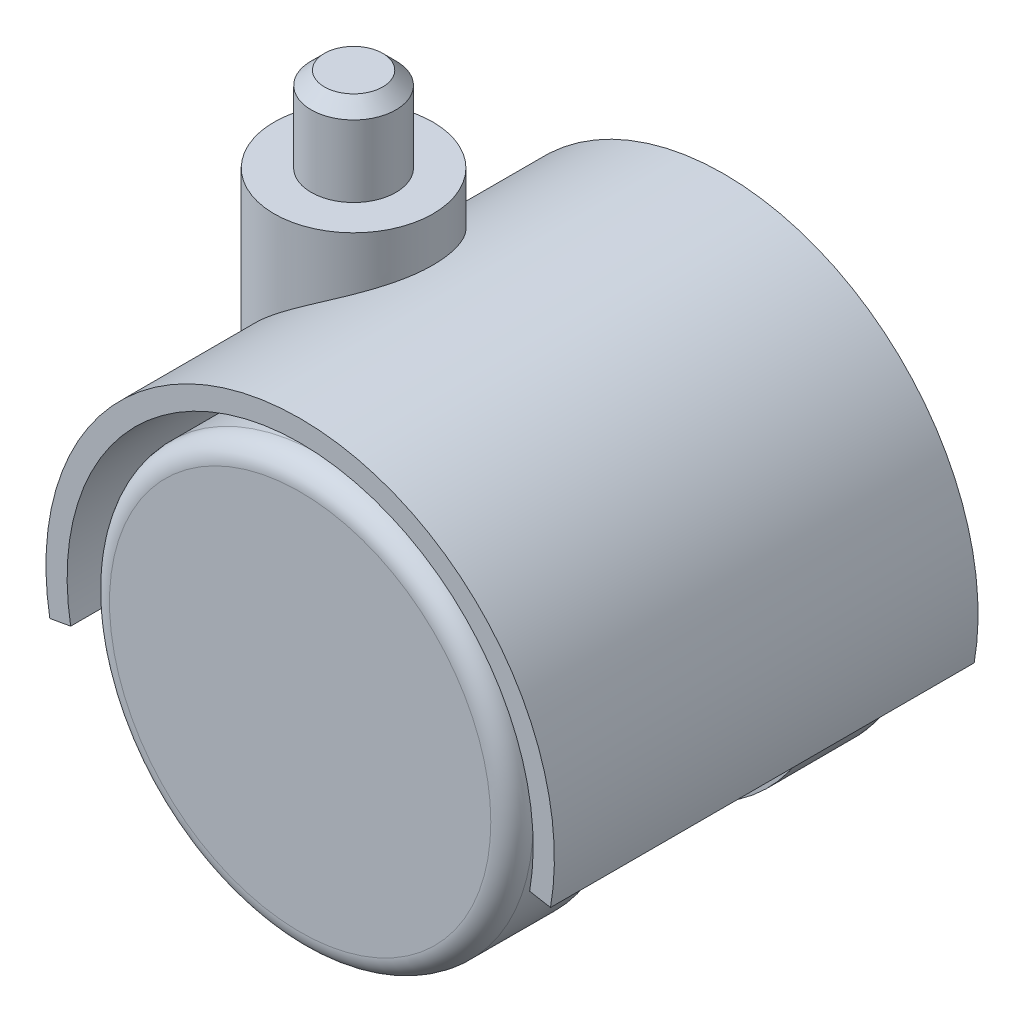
ISO-10303-21;
HEADER;
FILE_DESCRIPTION(('STEP AP214'),'2;1');
FILE_NAME('part.step','',(''),(''),'','','');
FILE_SCHEMA(('AUTOMOTIVE_DESIGN { 1 0 10303 214 1 1 1 1 }'));
ENDSEC;
DATA;
#1=APPLICATION_CONTEXT('core data for automotive mechanical design processes');
#2=APPLICATION_PROTOCOL_DEFINITION('international standard','automotive_design',2000,#1);
#3=PRODUCT_CONTEXT('',#1,'mechanical');
#4=PRODUCT('Part','Part','',(#3));
#5=PRODUCT_RELATED_PRODUCT_CATEGORY('part','',(#4));
#6=PRODUCT_DEFINITION_FORMATION('','',#4);
#7=PRODUCT_DEFINITION_CONTEXT('part definition',#1,'design');
#8=PRODUCT_DEFINITION('design','',#6,#7);
#9=PRODUCT_DEFINITION_SHAPE('','',#8);
#10=(LENGTH_UNIT() NAMED_UNIT(*) SI_UNIT(.MILLI.,.METRE.));
#11=(NAMED_UNIT(*) PLANE_ANGLE_UNIT() SI_UNIT($,.RADIAN.));
#12=(NAMED_UNIT(*) SI_UNIT($,.STERADIAN.) SOLID_ANGLE_UNIT());
#13=UNCERTAINTY_MEASURE_WITH_UNIT(LENGTH_MEASURE(1.E-05),#10,'distance_accuracy_value','');
#14=(GEOMETRIC_REPRESENTATION_CONTEXT(3) GLOBAL_UNCERTAINTY_ASSIGNED_CONTEXT((#13)) GLOBAL_UNIT_ASSIGNED_CONTEXT((#10,
#11,#12)) REPRESENTATION_CONTEXT('',''));
#15=CARTESIAN_POINT('',(0.,0.,0.));
#16=DIRECTION('',(0.,0.,1.));
#17=DIRECTION('',(1.,0.,0.));
#18=AXIS2_PLACEMENT_3D('',#15,#16,#17);
#19=CARTESIAN_POINT('',(0.,0.,0.));
#20=DIRECTION('',(0.,0.,-1.));
#21=DIRECTION('',(-1.,0.,0.));
#22=AXIS2_PLACEMENT_3D('',#19,#20,#21);
#23=CYLINDRICAL_SURFACE('',#22,4.99999999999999);
#24=CARTESIAN_POINT('',(0.,0.,30.));
#25=DIRECTION('',(0.,0.,-1.));
#26=DIRECTION('',(-1.,0.,0.));
#27=AXIS2_PLACEMENT_3D('',#24,#25,#26);
#28=CIRCLE('',#27,4.99999999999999);
#29=CARTESIAN_POINT('',(-4.99999999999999,0.,30.));
#30=VERTEX_POINT('',#29);
#31=EDGE_CURVE('E179',#30,#30,#28,.T.);
#32=ORIENTED_EDGE('',*,*,#31,.T.);
#33=EDGE_LOOP('',(#32));
#34=FACE_BOUND('',#33,.T.);
#35=CARTESIAN_POINT('',(0.,0.,9.99999999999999));
#36=DIRECTION('',(0.,0.,-1.));
#37=DIRECTION('',(-1.,0.,0.));
#38=AXIS2_PLACEMENT_3D('',#35,#36,#37);
#39=CIRCLE('',#38,5.);
#40=CARTESIAN_POINT('',(-5.,0.,9.99999999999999));
#41=VERTEX_POINT('',#40);
#42=EDGE_CURVE('E182',#41,#41,#39,.T.);
#43=ORIENTED_EDGE('',*,*,#42,.F.);
#44=EDGE_LOOP('',(#43));
#45=FACE_BOUND('',#44,.T.);
#46=CARTESIAN_POINT('',(0.,0.,15.));
#47=DIRECTION('',(0.,0.,-1.));
#48=DIRECTION('',(1.,0.,0.));
#49=AXIS2_PLACEMENT_3D('',#46,#47,#48);
#50=CIRCLE('',#49,5.);
#51=CARTESIAN_POINT('',(-4.82962913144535,-1.29409522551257,15.));
#52=VERTEX_POINT('',#51);
#53=CARTESIAN_POINT('',(4.82962913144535,-1.29409522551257,15.));
#54=VERTEX_POINT('',#53);
#55=EDGE_CURVE('E163',#52,#54,#50,.T.);
#56=ORIENTED_EDGE('',*,*,#55,.T.);
#57=DIRECTION('',(0.,0.,1.));
#58=VECTOR('',#57,1.);
#59=CARTESIAN_POINT('',(4.82962913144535,-1.29409522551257,15.));
#60=LINE('',#59,#58);
#61=CARTESIAN_POINT('',(4.82962913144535,-1.29409522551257,25.));
#62=VERTEX_POINT('',#61);
#63=EDGE_CURVE('E58',#54,#62,#60,.T.);
#64=ORIENTED_EDGE('',*,*,#63,.T.);
#65=CARTESIAN_POINT('',(0.,0.,25.));
#66=DIRECTION('',(0.,0.,-1.));
#67=DIRECTION('',(1.,0.,0.));
#68=AXIS2_PLACEMENT_3D('',#65,#66,#67);
#69=CIRCLE('',#68,5.);
#70=CARTESIAN_POINT('',(-4.82962913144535,-1.29409522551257,25.));
#71=VERTEX_POINT('',#70);
#72=EDGE_CURVE('E153',#71,#62,#69,.T.);
#73=ORIENTED_EDGE('',*,*,#72,.F.);
#74=DIRECTION('',(0.,0.,1.));
#75=VECTOR('',#74,1.);
#76=CARTESIAN_POINT('',(-4.82962913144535,-1.29409522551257,15.));
#77=LINE('',#76,#75);
#78=EDGE_CURVE('E174',#52,#71,#77,.T.);
#79=ORIENTED_EDGE('',*,*,#78,.F.);
#80=EDGE_LOOP('',(#56,#64,#73,#79));
#81=FACE_BOUND('',#80,.T.);
#82=ADVANCED_FACE('F35',(#34,#45,#81),#23,.T.);
#83=CARTESIAN_POINT('',(0.,0.,40.));
#84=DIRECTION('',(0.,0.,-1.));
#85=DIRECTION('',(-1.,0.,0.));
#86=AXIS2_PLACEMENT_3D('',#83,#84,#85);
#87=CYLINDRICAL_SURFACE('',#86,20.);
#88=CARTESIAN_POINT('',(0.,0.,2.));
#89=DIRECTION('',(0.,0.,1.));
#90=DIRECTION('',(1.,0.,0.));
#91=AXIS2_PLACEMENT_3D('',#88,#89,#90);
#92=CIRCLE('',#91,20.);
#93=CARTESIAN_POINT('',(20.,0.,2.));
#94=VERTEX_POINT('',#93);
#95=EDGE_CURVE('E188',#94,#94,#92,.T.);
#96=ORIENTED_EDGE('',*,*,#95,.T.);
#97=EDGE_LOOP('',(#96));
#98=FACE_BOUND('',#97,.T.);
#99=CARTESIAN_POINT('',(0.,0.,10.));
#100=DIRECTION('',(0.,0.,-1.));
#101=DIRECTION('',(-1.,0.,0.));
#102=AXIS2_PLACEMENT_3D('',#99,#100,#101);
#103=CIRCLE('',#102,20.);
#104=CARTESIAN_POINT('',(-20.,0.,10.));
#105=VERTEX_POINT('',#104);
#106=EDGE_CURVE('E185',#105,#105,#103,.T.);
#107=ORIENTED_EDGE('',*,*,#106,.T.);
#108=EDGE_LOOP('',(#107));
#109=FACE_BOUND('',#108,.T.);
#110=ADVANCED_FACE('F244',(#98,#109),#87,.T.);
#111=CARTESIAN_POINT('',(0.,0.,0.));
#112=DIRECTION('',(0.,0.,1.));
#113=DIRECTION('',(1.,0.,0.));
#114=AXIS2_PLACEMENT_3D('',#111,#112,#113);
#115=PLANE('',#114);
#116=CARTESIAN_POINT('',(0.,0.,0.));
#117=DIRECTION('',(0.,0.,1.));
#118=DIRECTION('',(1.,0.,0.));
#119=AXIS2_PLACEMENT_3D('',#116,#117,#118);
#120=CIRCLE('',#119,18.);
#121=CARTESIAN_POINT('',(18.,0.,0.));
#122=VERTEX_POINT('',#121);
#123=EDGE_CURVE('E191',#122,#122,#120,.F.);
#124=ORIENTED_EDGE('',*,*,#123,.T.);
#125=EDGE_LOOP('',(#124));
#126=FACE_BOUND('',#125,.T.);
#127=ADVANCED_FACE('F248',(#126),#115,.F.);
#128=CARTESIAN_POINT('',(0.,20.,10.));
#129=DIRECTION('',(0.,0.,-1.));
#130=DIRECTION('',(-1.,0.,0.));
#131=AXIS2_PLACEMENT_3D('',#128,#129,#130);
#132=PLANE('',#131);
#133=ORIENTED_EDGE('',*,*,#106,.F.);
#134=EDGE_LOOP('',(#133));
#135=FACE_BOUND('',#134,.T.);
#136=ORIENTED_EDGE('',*,*,#42,.T.);
#137=EDGE_LOOP('',(#136));
#138=FACE_BOUND('',#137,.T.);
#139=ADVANCED_FACE('F240',(#135,#138),#132,.F.);
#140=CARTESIAN_POINT('',(0.,20.,30.));
#141=DIRECTION('',(0.,0.,1.));
#142=DIRECTION('',(1.,0.,0.));
#143=AXIS2_PLACEMENT_3D('',#140,#141,#142);
#144=PLANE('',#143);
#145=ORIENTED_EDGE('',*,*,#31,.F.);
#146=EDGE_LOOP('',(#145));
#147=FACE_BOUND('',#146,.T.);
#148=CARTESIAN_POINT('',(0.,0.,30.));
#149=DIRECTION('',(0.,0.,-1.));
#150=DIRECTION('',(-1.,0.,0.));
#151=AXIS2_PLACEMENT_3D('',#148,#149,#150);
#152=CIRCLE('',#151,20.);
#153=CARTESIAN_POINT('',(-20.,0.,30.));
#154=VERTEX_POINT('',#153);
#155=EDGE_CURVE('E172',#154,#154,#152,.T.);
#156=ORIENTED_EDGE('',*,*,#155,.T.);
#157=EDGE_LOOP('',(#156));
#158=FACE_BOUND('',#157,.T.);
#159=ADVANCED_FACE('F236',(#147,#158),#144,.F.);
#160=CARTESIAN_POINT('',(0.,0.,40.));
#161=DIRECTION('',(0.,0.,1.));
#162=DIRECTION('',(1.,0.,0.));
#163=AXIS2_PLACEMENT_3D('',#160,#161,#162);
#164=PLANE('',#163);
#165=CARTESIAN_POINT('',(0.,0.,40.));
#166=DIRECTION('',(0.,0.,1.));
#167=DIRECTION('',(1.,0.,0.));
#168=AXIS2_PLACEMENT_3D('',#165,#166,#167);
#169=CIRCLE('',#168,18.);
#170=CARTESIAN_POINT('',(18.,0.,40.));
#171=VERTEX_POINT('',#170);
#172=EDGE_CURVE('E194',#171,#171,#169,.T.);
#173=ORIENTED_EDGE('',*,*,#172,.T.);
#174=EDGE_LOOP('',(#173));
#175=FACE_BOUND('',#174,.T.);
#176=ADVANCED_FACE('F239',(#175),#164,.T.);
#177=CARTESIAN_POINT('',(0.,0.,38.));
#178=DIRECTION('',(0.,0.,1.));
#179=DIRECTION('',(1.,0.,0.));
#180=AXIS2_PLACEMENT_3D('',#177,#178,#179);
#181=CIRCLE('',#180,20.);
#182=CARTESIAN_POINT('',(20.,0.,38.));
#183=VERTEX_POINT('',#182);
#184=EDGE_CURVE('E197',#183,#183,#181,.F.);
#185=ORIENTED_EDGE('',*,*,#184,.T.);
#186=EDGE_LOOP('',(#185));
#187=FACE_BOUND('',#186,.T.);
#188=ORIENTED_EDGE('',*,*,#155,.F.);
#189=EDGE_LOOP('',(#188));
#190=FACE_BOUND('',#189,.T.);
#191=ADVANCED_FACE('F252',(#187,#190),#87,.T.);
#192=CARTESIAN_POINT('',(0.,0.,2.));
#193=DIRECTION('',(0.,0.,1.));
#194=DIRECTION('',(1.,0.,0.));
#195=AXIS2_PLACEMENT_3D('',#192,#193,#194);
#196=TOROIDAL_SURFACE('',#195,18.,2.);
#197=ORIENTED_EDGE('',*,*,#123,.F.);
#198=EDGE_LOOP('',(#197));
#199=FACE_BOUND('',#198,.T.);
#200=ORIENTED_EDGE('',*,*,#95,.F.);
#201=EDGE_LOOP('',(#200));
#202=FACE_BOUND('',#201,.T.);
#203=ADVANCED_FACE('F259',(#199,#202),#196,.T.);
#204=CARTESIAN_POINT('',(0.,0.,38.));
#205=DIRECTION('',(0.,0.,1.));
#206=DIRECTION('',(1.,0.,0.));
#207=AXIS2_PLACEMENT_3D('',#204,#205,#206);
#208=TOROIDAL_SURFACE('',#207,18.,2.);
#209=ORIENTED_EDGE('',*,*,#184,.F.);
#210=EDGE_LOOP('',(#209));
#211=FACE_BOUND('',#210,.T.);
#212=ORIENTED_EDGE('',*,*,#172,.F.);
#213=EDGE_LOOP('',(#212));
#214=FACE_BOUND('',#213,.T.);
#215=ADVANCED_FACE('F232',(#211,#214),#208,.T.);
#216=CARTESIAN_POINT('',(10.3746421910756,19.400175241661,15.));
#217=DIRECTION('',(0.96592582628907,-0.258819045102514,0.));
#218=DIRECTION('',(0.258819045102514,0.96592582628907,0.));
#219=AXIS2_PLACEMENT_3D('',#216,#217,#218);
#220=PLANE('',#219);
#221=DIRECTION('',(0.,0.,1.));
#222=VECTOR('',#221,1.);
#223=CARTESIAN_POINT('',(10.3746421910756,19.400175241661,15.));
#224=LINE('',#223,#222);
#225=CARTESIAN_POINT('',(10.3746421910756,19.400175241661,15.));
#226=VERTEX_POINT('',#225);
#227=CARTESIAN_POINT('',(10.3746421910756,19.400175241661,25.));
#228=VERTEX_POINT('',#227);
#229=EDGE_CURVE('E169',#226,#228,#224,.T.);
#230=ORIENTED_EDGE('',*,*,#229,.T.);
#231=DIRECTION('',(0.258819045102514,0.96592582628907,0.));
#232=VECTOR('',#231,1.);
#233=CARTESIAN_POINT('',(10.3746421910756,19.400175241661,25.));
#234=LINE('',#233,#232);
#235=EDGE_CURVE('E155',#62,#228,#234,.T.);
#236=ORIENTED_EDGE('',*,*,#235,.F.);
#237=ORIENTED_EDGE('',*,*,#63,.F.);
#238=DIRECTION('',(0.258819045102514,0.96592582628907,0.));
#239=VECTOR('',#238,1.);
#240=CARTESIAN_POINT('',(10.3746421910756,19.400175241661,15.));
#241=LINE('',#240,#239);
#242=EDGE_CURVE('E166',#54,#226,#241,.T.);
#243=ORIENTED_EDGE('',*,*,#242,.T.);
#244=EDGE_LOOP('',(#230,#236,#237,#243));
#245=FACE_BOUND('',#244,.T.);
#246=ADVANCED_FACE('F229',(#245),#220,.T.);
#247=CARTESIAN_POINT('',(-10.3746421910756,19.400175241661,15.));
#248=DIRECTION('',(-0.96592582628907,-0.258819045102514,0.));
#249=DIRECTION('',(0.258819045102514,-0.96592582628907,0.));
#250=AXIS2_PLACEMENT_3D('',#247,#248,#249);
#251=PLANE('',#250);
#252=ORIENTED_EDGE('',*,*,#78,.T.);
#253=DIRECTION('',(0.258819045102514,-0.96592582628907,0.));
#254=VECTOR('',#253,1.);
#255=CARTESIAN_POINT('',(-10.3746421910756,19.400175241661,25.));
#256=LINE('',#255,#254);
#257=CARTESIAN_POINT('',(-10.3746421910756,19.400175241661,25.));
#258=VERTEX_POINT('',#257);
#259=EDGE_CURVE('E50',#258,#71,#256,.T.);
#260=ORIENTED_EDGE('',*,*,#259,.F.);
#261=DIRECTION('',(0.,0.,1.));
#262=VECTOR('',#261,1.);
#263=CARTESIAN_POINT('',(-10.3746421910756,19.400175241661,15.));
#264=LINE('',#263,#262);
#265=CARTESIAN_POINT('',(-10.3746421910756,19.400175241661,15.));
#266=VERTEX_POINT('',#265);
#267=EDGE_CURVE('E168',#266,#258,#264,.T.);
#268=ORIENTED_EDGE('',*,*,#267,.F.);
#269=DIRECTION('',(0.258819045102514,-0.96592582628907,0.));
#270=VECTOR('',#269,1.);
#271=CARTESIAN_POINT('',(-10.3746421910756,19.400175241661,15.));
#272=LINE('',#271,#270);
#273=EDGE_CURVE('E160',#266,#52,#272,.T.);
#274=ORIENTED_EDGE('',*,*,#273,.T.);
#275=EDGE_LOOP('',(#252,#260,#268,#274));
#276=FACE_BOUND('',#275,.T.);
#277=ADVANCED_FACE('F227',(#276),#251,.T.);
#278=CARTESIAN_POINT('',(0.,0.,15.));
#279=DIRECTION('',(0.,0.,1.));
#280=DIRECTION('',(1.,0.,0.));
#281=AXIS2_PLACEMENT_3D('',#278,#279,#280);
#282=PLANE('',#281);
#283=CARTESIAN_POINT('',(0.,0.,15.));
#284=DIRECTION('',(0.,0.,1.));
#285=DIRECTION('',(1.,0.,0.));
#286=AXIS2_PLACEMENT_3D('',#283,#284,#285);
#287=CIRCLE('',#286,22.);
#288=EDGE_CURVE('E158',#226,#266,#287,.T.);
#289=ORIENTED_EDGE('',*,*,#288,.F.);
#290=ORIENTED_EDGE('',*,*,#242,.F.);
#291=ORIENTED_EDGE('',*,*,#55,.F.);
#292=ORIENTED_EDGE('',*,*,#273,.F.);
#293=EDGE_LOOP('',(#289,#290,#291,#292));
#294=FACE_BOUND('',#293,.T.);
#295=ADVANCED_FACE('F224',(#294),#282,.F.);
#296=CARTESIAN_POINT('',(0.,0.,25.));
#297=DIRECTION('',(0.,0.,1.));
#298=DIRECTION('',(1.,0.,0.));
#299=AXIS2_PLACEMENT_3D('',#296,#297,#298);
#300=PLANE('',#299);
#301=CARTESIAN_POINT('',(0.,0.,25.));
#302=DIRECTION('',(0.,0.,1.));
#303=DIRECTION('',(1.,0.,0.));
#304=AXIS2_PLACEMENT_3D('',#301,#302,#303);
#305=CIRCLE('',#304,22.);
#306=EDGE_CURVE('E113',#228,#258,#305,.T.);
#307=ORIENTED_EDGE('',*,*,#306,.T.);
#308=ORIENTED_EDGE('',*,*,#259,.T.);
#309=ORIENTED_EDGE('',*,*,#72,.T.);
#310=ORIENTED_EDGE('',*,*,#235,.T.);
#311=EDGE_LOOP('',(#307,#308,#309,#310));
#312=FACE_BOUND('',#311,.T.);
#313=ADVANCED_FACE('F221',(#312),#300,.T.);
#314=CARTESIAN_POINT('',(0.,0.,40.));
#315=DIRECTION('',(0.,0.,-1.));
#316=DIRECTION('',(-1.,0.,0.));
#317=AXIS2_PLACEMENT_3D('',#314,#315,#316);
#318=CYLINDRICAL_SURFACE('',#317,22.);
#319=CARTESIAN_POINT('',(0.,0.,0.));
#320=DIRECTION('',(0.,0.,1.));
#321=DIRECTION('',(1.,0.,0.));
#322=AXIS2_PLACEMENT_3D('',#319,#320,#321);
#323=CIRCLE('',#322,22.);
#324=CARTESIAN_POINT('',(21.6657705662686,-3.82025990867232,0.));
#325=VERTEX_POINT('',#324);
#326=CARTESIAN_POINT('',(-21.6657705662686,-3.82025990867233,0.));
#327=VERTEX_POINT('',#326);
#328=EDGE_CURVE('E127',#325,#327,#323,.T.);
#329=ORIENTED_EDGE('',*,*,#328,.F.);
#330=DIRECTION('',(0.,0.,-1.));
#331=VECTOR('',#330,1.);
#332=CARTESIAN_POINT('',(21.6657705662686,-3.82025990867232,40.));
#333=LINE('',#332,#331);
#334=CARTESIAN_POINT('',(21.6657705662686,-3.82025990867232,40.));
#335=VERTEX_POINT('',#334);
#336=EDGE_CURVE('E140',#335,#325,#333,.T.);
#337=ORIENTED_EDGE('',*,*,#336,.F.);
#338=CARTESIAN_POINT('',(0.,0.,40.));
#339=DIRECTION('',(0.,0.,1.));
#340=DIRECTION('',(1.,0.,0.));
#341=AXIS2_PLACEMENT_3D('',#338,#339,#340);
#342=CIRCLE('',#341,22.);
#343=CARTESIAN_POINT('',(-21.6657705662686,-3.82025990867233,40.));
#344=VERTEX_POINT('',#343);
#345=EDGE_CURVE('E126',#335,#344,#342,.T.);
#346=ORIENTED_EDGE('',*,*,#345,.T.);
#347=DIRECTION('',(0.,0.,-1.));
#348=VECTOR('',#347,1.);
#349=CARTESIAN_POINT('',(-21.6657705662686,-3.82025990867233,40.));
#350=LINE('',#349,#348);
#351=EDGE_CURVE('E148',#344,#327,#350,.T.);
#352=ORIENTED_EDGE('',*,*,#351,.T.);
#353=EDGE_LOOP('',(#329,#337,#346,#352));
#354=FACE_BOUND('',#353,.T.);
#355=ORIENTED_EDGE('',*,*,#288,.T.);
#356=ORIENTED_EDGE('',*,*,#267,.T.);
#357=ORIENTED_EDGE('',*,*,#306,.F.);
#358=ORIENTED_EDGE('',*,*,#229,.F.);
#359=EDGE_LOOP('',(#355,#356,#357,#358));
#360=FACE_BOUND('',#359,.T.);
#361=ADVANCED_FACE('F220',(#354,#360),#318,.F.);
#362=CARTESIAN_POINT('',(0.,1.57169959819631E-13,40.));
#363=DIRECTION('',(-0.173648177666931,-0.984807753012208,0.));
#364=DIRECTION('',(0.984807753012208,-0.173648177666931,0.));
#365=AXIS2_PLACEMENT_3D('',#362,#363,#364);
#366=PLANE('',#365);
#367=DIRECTION('',(-0.984807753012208,0.173648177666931,0.));
#368=VECTOR('',#367,1.);
#369=CARTESIAN_POINT('',(0.,1.57169959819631E-13,0.));
#370=LINE('',#369,#368);
#371=CARTESIAN_POINT('',(23.635386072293,-4.16755626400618,0.));
#372=VERTEX_POINT('',#371);
#373=EDGE_CURVE('E110',#372,#325,#370,.T.);
#374=ORIENTED_EDGE('',*,*,#373,.F.);
#375=DIRECTION('',(0.,0.,-1.));
#376=VECTOR('',#375,1.);
#377=CARTESIAN_POINT('',(23.635386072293,-4.16755626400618,40.));
#378=LINE('',#377,#376);
#379=CARTESIAN_POINT('',(23.635386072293,-4.16755626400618,40.));
#380=VERTEX_POINT('',#379);
#381=EDGE_CURVE('E103',#380,#372,#378,.T.);
#382=ORIENTED_EDGE('',*,*,#381,.F.);
#383=DIRECTION('',(-0.984807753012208,0.173648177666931,0.));
#384=VECTOR('',#383,1.);
#385=CARTESIAN_POINT('',(0.,1.57169959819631E-13,40.));
#386=LINE('',#385,#384);
#387=EDGE_CURVE('E107',#380,#335,#386,.T.);
#388=ORIENTED_EDGE('',*,*,#387,.T.);
#389=ORIENTED_EDGE('',*,*,#336,.T.);
#390=EDGE_LOOP('',(#374,#382,#388,#389));
#391=FACE_BOUND('',#390,.T.);
#392=ADVANCED_FACE('F105',(#391),#366,.T.);
#393=CARTESIAN_POINT('',(0.,0.,40.));
#394=DIRECTION('',(0.,0.,-1.));
#395=DIRECTION('',(-1.,0.,0.));
#396=AXIS2_PLACEMENT_3D('',#393,#394,#395);
#397=CYLINDRICAL_SURFACE('',#396,24.);
#398=CARTESIAN_POINT('',(-14.9549644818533,18.7709625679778,12.5));
#399=CARTESIAN_POINT('',(-14.8611541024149,18.845702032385,12.5000003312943));
#400=CARTESIAN_POINT('',(-14.7667611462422,18.9197159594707,12.5017635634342));
#401=CARTESIAN_POINT('',(-14.5777184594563,19.0656357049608,12.508909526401));
#402=CARTESIAN_POINT('',(-14.4830770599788,19.137553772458,12.5142627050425));
#403=CARTESIAN_POINT('',(-14.2936930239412,19.2792605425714,12.5286195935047));
#404=CARTESIAN_POINT('',(-14.1989575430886,19.3490618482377,12.5375930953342));
#405=CARTESIAN_POINT('',(-14.0095377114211,19.4865140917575,12.5592185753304));
#406=CARTESIAN_POINT('',(-13.9148592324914,19.5541779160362,12.5718399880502));
#407=CARTESIAN_POINT('',(-13.7256999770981,19.6873364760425,12.6007855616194));
#408=CARTESIAN_POINT('',(-13.6312237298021,19.752844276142,12.6170791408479));
#409=CARTESIAN_POINT('',(-13.442610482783,19.8816738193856,12.6533897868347));
#410=CARTESIAN_POINT('',(-13.3484766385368,19.9450086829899,12.6733766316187));
#411=CARTESIAN_POINT('',(-13.1606845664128,20.0694771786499,12.7170911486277));
#412=CARTESIAN_POINT('',(-13.0670281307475,20.130623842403,12.7407893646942));
#413=CARTESIAN_POINT('',(-12.880322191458,20.2507028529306,12.791940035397));
#414=CARTESIAN_POINT('',(-12.7872731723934,20.3096479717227,12.819364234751));
#415=CARTESIAN_POINT('',(-12.6019082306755,20.4253116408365,12.8779784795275));
#416=CARTESIAN_POINT('',(-12.5095915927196,20.4820425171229,12.9091419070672));
#417=CARTESIAN_POINT('',(-12.3258128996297,20.5932709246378,12.9752367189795));
#418=CARTESIAN_POINT('',(-12.2343490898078,20.6477800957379,13.0101436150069));
#419=CARTESIAN_POINT('',(-12.0524066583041,20.7545375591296,13.0837403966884));
#420=CARTESIAN_POINT('',(-11.9619253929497,20.8067969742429,13.122407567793));
#421=CARTESIAN_POINT('',(-11.7822091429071,20.9089945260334,13.2035992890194));
#422=CARTESIAN_POINT('',(-11.6929699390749,20.9589446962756,13.2460993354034));
#423=CARTESIAN_POINT('',(-11.5159537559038,21.056556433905,13.3347976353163));
#424=CARTESIAN_POINT('',(-11.4281711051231,21.1042304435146,13.3809708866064));
#425=CARTESIAN_POINT('',(-11.2542803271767,21.1973042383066,13.4769073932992));
#426=CARTESIAN_POINT('',(-11.1681649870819,21.2427169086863,13.5266450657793));
#427=CARTESIAN_POINT('',(-10.9978101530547,21.331288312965,13.6295913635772));
#428=CARTESIAN_POINT('',(-10.9135618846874,21.3744602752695,13.6827740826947));
#429=CARTESIAN_POINT('',(-10.747134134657,21.4585697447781,13.7924967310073));
#430=CARTESIAN_POINT('',(-10.6649443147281,21.4995207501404,13.8490106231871));
#431=CARTESIAN_POINT('',(-10.5028174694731,21.5792087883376,13.965282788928));
#432=CARTESIAN_POINT('',(-10.4228685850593,21.6179594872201,14.0250151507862));
#433=CARTESIAN_POINT('',(-10.2653990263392,21.6932678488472,14.1476135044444));
#434=CARTESIAN_POINT('',(-10.1878650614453,21.7298392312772,14.2104539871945));
#435=CARTESIAN_POINT('',(-10.0353920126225,21.8008107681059,14.3391592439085));
#436=CARTESIAN_POINT('',(-9.96043835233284,21.8352245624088,14.4049992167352));
#437=CARTESIAN_POINT('',(-9.8132847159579,21.9019025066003,14.5395966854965));
#438=CARTESIAN_POINT('',(-9.74106907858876,21.9341800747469,14.6083304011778));
#439=CARTESIAN_POINT('',(-9.59953966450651,21.9966108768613,14.748606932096));
#440=CARTESIAN_POINT('',(-9.53020942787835,22.0267771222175,14.8201273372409));
#441=CARTESIAN_POINT('',(-9.39459998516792,22.0849993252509,14.9658814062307));
#442=CARTESIAN_POINT('',(-9.32830376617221,22.1130678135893,15.0400942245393));
#443=CARTESIAN_POINT('',(-9.19893750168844,22.1672122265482,15.1910867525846));
#444=CARTESIAN_POINT('',(-9.13584938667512,22.1932998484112,15.2678467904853));
#445=CARTESIAN_POINT('',(-9.01295284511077,22.2435434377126,15.4236815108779));
#446=CARTESIAN_POINT('',(-8.95312547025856,22.2677110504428,15.5027375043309));
#447=CARTESIAN_POINT('',(-8.83682303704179,22.31417949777,15.662939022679));
#448=CARTESIAN_POINT('',(-8.78032786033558,22.3364919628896,15.7440665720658));
#449=CARTESIAN_POINT('',(-8.6707511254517,22.37931199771,15.9081887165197));
#450=CARTESIAN_POINT('',(-8.61764823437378,22.399831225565,15.9911660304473));
#451=CARTESIAN_POINT('',(-8.51491406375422,22.4391256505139,16.1587742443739));
#452=CARTESIAN_POINT('',(-8.46526017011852,22.457912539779,16.2433885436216));
#453=CARTESIAN_POINT('',(-8.36947664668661,22.493801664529,16.4140643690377));
#454=CARTESIAN_POINT('',(-8.32332310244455,22.5109156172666,16.5001100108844));
#455=CARTESIAN_POINT('',(-8.23458817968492,22.543516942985,16.6734495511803));
#456=CARTESIAN_POINT('',(-8.19198159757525,22.5590160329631,16.7607283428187));
#457=CARTESIAN_POINT('',(-8.11038379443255,22.5884443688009,16.9363423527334));
#458=CARTESIAN_POINT('',(-8.07136612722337,22.6023852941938,17.0246633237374));
#459=CARTESIAN_POINT('',(-7.99698427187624,22.6287528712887,17.2021767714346));
#460=CARTESIAN_POINT('',(-7.96159248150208,22.6411911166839,17.2913559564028));
#461=CARTESIAN_POINT('',(-7.89449721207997,22.6646072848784,17.4704080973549));
#462=CARTESIAN_POINT('',(-7.86276508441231,22.6755966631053,17.5602688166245));
#463=CARTESIAN_POINT('',(-7.80301433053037,22.6961692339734,17.7405117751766));
#464=CARTESIAN_POINT('',(-7.77496621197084,22.7057636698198,17.8308829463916));
#465=CARTESIAN_POINT('',(-7.72262013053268,22.7235950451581,18.0119946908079));
#466=CARTESIAN_POINT('',(-7.69829221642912,22.7318428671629,18.1027255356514));
#467=CARTESIAN_POINT('',(-7.65330042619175,22.7470897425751,18.2844213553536));
#468=CARTESIAN_POINT('',(-7.63260888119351,22.7540982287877,18.3753786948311));
#469=CARTESIAN_POINT('',(-7.59480358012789,22.7668890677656,18.5573671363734));
#470=CARTESIAN_POINT('',(-7.57766289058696,22.7726806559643,18.6483919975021));
#471=CARTESIAN_POINT('',(-7.54688394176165,22.7830695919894,18.8303549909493));
#472=CARTESIAN_POINT('',(-7.53321900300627,22.7876760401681,18.921288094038));
#473=CARTESIAN_POINT('',(-7.50931469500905,22.7957234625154,19.1029139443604));
#474=CARTESIAN_POINT('',(-7.49904882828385,22.7991734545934,19.1936028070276));
#475=CARTESIAN_POINT('',(-7.48186686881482,22.8049371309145,19.374593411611));
#476=CARTESIAN_POINT('',(-7.47492439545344,22.8072597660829,19.4648923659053));
#477=CARTESIAN_POINT('',(-7.46431378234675,22.8107973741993,19.6449630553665));
#478=CARTESIAN_POINT('',(-7.46061934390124,22.8120212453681,19.7347330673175));
#479=CARTESIAN_POINT('',(-7.45642987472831,22.8133897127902,19.913612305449));
#480=CARTESIAN_POINT('',(-7.45590861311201,22.8135431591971,20.0027208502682));
#481=CARTESIAN_POINT('',(-7.45799102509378,22.8127988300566,20.1801499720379));
#482=CARTESIAN_POINT('',(-7.46056854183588,22.8119098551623,20.2684708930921));
#483=CARTESIAN_POINT('',(-7.46877446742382,22.8091085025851,20.4442038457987));
#484=CARTESIAN_POINT('',(-7.47437681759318,22.8072048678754,20.5316172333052));
#485=CARTESIAN_POINT('',(-7.48855885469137,22.8024015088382,20.7054202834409));
#486=CARTESIAN_POINT('',(-7.49711262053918,22.7995104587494,20.7918123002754));
#487=CARTESIAN_POINT('',(-7.5171241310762,22.7927600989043,20.9634638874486));
#488=CARTESIAN_POINT('',(-7.52855614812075,22.7889093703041,21.0487267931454));
#489=CARTESIAN_POINT('',(-7.55425201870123,22.7802642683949,21.2180168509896));
#490=CARTESIAN_POINT('',(-7.56849039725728,22.7754783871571,21.302048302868));
#491=CARTESIAN_POINT('',(-7.59972434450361,22.7649981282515,21.468779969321));
#492=CARTESIAN_POINT('',(-7.6166948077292,22.7593120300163,21.5514854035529));
#493=CARTESIAN_POINT('',(-7.6533349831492,22.7470220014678,21.7154854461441));
#494=CARTESIAN_POINT('',(-7.6729805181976,22.7404262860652,21.7967860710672));
#495=CARTESIAN_POINT('',(-7.71483309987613,22.7263155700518,21.9579079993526));
#496=CARTESIAN_POINT('',(-7.7370171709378,22.7188087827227,22.0377359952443));
#497=CARTESIAN_POINT('',(-7.78381101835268,22.7028901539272,22.1958409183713));
#498=CARTESIAN_POINT('',(-7.80839854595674,22.6944865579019,22.27412526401));
#499=CARTESIAN_POINT('',(-7.85986781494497,22.6767851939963,22.4290753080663));
#500=CARTESIAN_POINT('',(-7.88672793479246,22.6674957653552,22.5057491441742));
#501=CARTESIAN_POINT('',(-7.94261485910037,22.6480351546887,22.6574153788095));
#502=CARTESIAN_POINT('',(-7.9716205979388,22.6378724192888,22.7324166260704));
#503=CARTESIAN_POINT('',(-8.03167515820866,22.6166778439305,22.8806793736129));
#504=CARTESIAN_POINT('',(-8.06270342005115,22.6056545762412,22.9539504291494));
#505=CARTESIAN_POINT('',(-8.12668323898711,22.5827521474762,23.0986989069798));
#506=CARTESIAN_POINT('',(-8.15961471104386,22.5708816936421,23.1701865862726));
#507=CARTESIAN_POINT('',(-8.2272848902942,22.5462985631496,23.3113187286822));
#508=CARTESIAN_POINT('',(-8.26200397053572,22.5335947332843,23.3809741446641));
#509=CARTESIAN_POINT('',(-8.33313694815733,22.5073589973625,23.518396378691));
#510=CARTESIAN_POINT('',(-8.36953167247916,22.493836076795,23.5861748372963));
#511=CARTESIAN_POINT('',(-8.44390706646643,22.4659767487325,23.7198018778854));
#512=CARTESIAN_POINT('',(-8.48186902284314,22.4516494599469,23.785662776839));
#513=CARTESIAN_POINT('',(-8.55927351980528,22.4221964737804,23.9154174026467));
#514=CARTESIAN_POINT('',(-8.59869782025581,22.4070800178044,23.9793241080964));
#515=CARTESIAN_POINT('',(-8.67892490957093,22.3760640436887,24.1051370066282));
#516=CARTESIAN_POINT('',(-8.71970995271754,22.3601738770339,24.1670568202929));
#517=CARTESIAN_POINT('',(-8.80256023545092,22.3276268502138,24.2888661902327));
#518=CARTESIAN_POINT('',(-8.84460824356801,22.3109794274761,24.348769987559));
#519=CARTESIAN_POINT('',(-8.92988763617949,22.2769324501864,24.466522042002));
#520=CARTESIAN_POINT('',(-8.97310234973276,22.2595424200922,24.5243851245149));
#521=CARTESIAN_POINT('',(-9.0606280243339,22.2240333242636,24.63803128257));
#522=CARTESIAN_POINT('',(-9.1049228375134,22.2059237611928,24.6938297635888));
#523=CARTESIAN_POINT('',(-9.19449335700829,22.1689720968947,24.8033271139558));
#524=CARTESIAN_POINT('',(-9.2397534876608,22.1501399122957,24.8570420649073));
#525=CARTESIAN_POINT('',(-9.3311181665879,22.1117610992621,24.9623957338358));
#526=CARTESIAN_POINT('',(-9.37720828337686,22.0922244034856,25.0140506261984));
#527=CARTESIAN_POINT('',(-9.51584740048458,22.0329168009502,25.1651322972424));
#528=CARTESIAN_POINT('',(-9.61019638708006,21.9918592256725,25.2624191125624));
#529=CARTESIAN_POINT('',(-9.80112389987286,21.9072426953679,25.449004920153));
#530=CARTESIAN_POINT('',(-9.89761137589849,21.8637561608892,25.5384303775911));
#531=CARTESIAN_POINT('',(-10.0921010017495,21.7745211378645,25.7095720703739));
#532=CARTESIAN_POINT('',(-10.1900249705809,21.7288421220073,25.7914134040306));
#533=CARTESIAN_POINT('',(-10.3867270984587,21.6354554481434,25.9476583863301));
#534=CARTESIAN_POINT('',(-10.4854383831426,21.5878150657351,26.0221865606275));
#535=CARTESIAN_POINT('',(-10.6831188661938,21.4907295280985,26.1640840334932));
#536=CARTESIAN_POINT('',(-10.7820311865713,21.4413500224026,26.2315775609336));
#537=CARTESIAN_POINT('',(-10.9795755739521,21.3410020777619,26.3596856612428));
#538=CARTESIAN_POINT('',(-11.0781598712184,21.2900980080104,26.4204243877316));
#539=CARTESIAN_POINT('',(-11.2745620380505,21.1869089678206,26.5353117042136));
#540=CARTESIAN_POINT('',(-11.3723406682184,21.1346872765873,26.589584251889));
#541=CARTESIAN_POINT('',(-11.5667076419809,21.0290631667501,26.6918099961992));
#542=CARTESIAN_POINT('',(-11.663264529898,20.9757230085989,26.7398873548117));
#543=CARTESIAN_POINT('',(-11.8548891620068,20.8679915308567,26.8301236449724));
#544=CARTESIAN_POINT('',(-11.9499348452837,20.813658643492,26.8723993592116));
#545=CARTESIAN_POINT('',(-12.1383111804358,20.7041757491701,26.951556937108));
#546=CARTESIAN_POINT('',(-12.2316275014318,20.6490775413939,26.9885447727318));
#547=CARTESIAN_POINT('',(-12.4162989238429,20.5383211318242,27.0575220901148));
#548=CARTESIAN_POINT('',(-12.5076450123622,20.4827110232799,27.089613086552));
#549=CARTESIAN_POINT('',(-12.6881546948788,20.3711693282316,27.1491859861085));
#550=CARTESIAN_POINT('',(-12.7773140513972,20.3152827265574,27.176765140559));
#551=CARTESIAN_POINT('',(-12.953261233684,20.2034087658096,27.2276795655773));
#552=CARTESIAN_POINT('',(-13.0400489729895,20.1474637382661,27.2511083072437));
#553=CARTESIAN_POINT('',(-13.2110911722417,20.0356771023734,27.294068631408));
#554=CARTESIAN_POINT('',(-13.2953492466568,19.979875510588,27.3136901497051));
#555=CARTESIAN_POINT('',(-13.4611980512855,19.8685636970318,27.3493648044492));
#556=CARTESIAN_POINT('',(-13.5427956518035,19.8130914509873,27.3655045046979));
#557=CARTESIAN_POINT('',(-13.7032088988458,19.7026131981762,27.394524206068));
#558=CARTESIAN_POINT('',(-13.7820344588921,19.6476432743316,27.4074875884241));
#559=CARTESIAN_POINT('',(-14.0104894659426,19.4863036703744,27.441385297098));
#560=CARTESIAN_POINT('',(-14.1596026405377,19.3784614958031,27.4589087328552));
#561=CARTESIAN_POINT('',(-14.4458162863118,19.1662447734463,27.4839200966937));
#562=CARTESIAN_POINT('',(-14.5830527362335,19.0621213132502,27.4920012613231));
#563=CARTESIAN_POINT('',(-14.84591632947,18.8579913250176,27.5002848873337));
#564=CARTESIAN_POINT('',(-14.9716917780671,18.7581955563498,27.5009919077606));
#565=CARTESIAN_POINT('',(-15.2120795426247,18.5634879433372,27.496394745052));
#566=CARTESIAN_POINT('',(-15.3268395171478,18.468747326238,27.4915231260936));
#567=CARTESIAN_POINT('',(-15.5454135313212,18.2848886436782,27.4772831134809));
#568=CARTESIAN_POINT('',(-15.6493763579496,18.1959173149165,27.4683001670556));
#569=CARTESIAN_POINT('',(-15.8466310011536,18.024217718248,27.4471682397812));
#570=CARTESIAN_POINT('',(-15.9400687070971,17.9416142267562,27.4353598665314));
#571=CARTESIAN_POINT('',(-16.1915962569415,17.7158084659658,27.3988238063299));
#572=CARTESIAN_POINT('',(-16.3482044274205,17.5714572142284,27.3708921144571));
#573=CARTESIAN_POINT('',(-16.6221773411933,17.3122206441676,27.3131883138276));
#574=CARTESIAN_POINT('',(-16.7405052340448,17.1979430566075,27.285215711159));
#575=CARTESIAN_POINT('',(-16.9406150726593,17.0006719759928,27.2328121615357));
#576=CARTESIAN_POINT('',(-17.0231505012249,16.9181004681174,27.2096643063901));
#577=CARTESIAN_POINT('',(-17.1539201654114,16.7853182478,27.1705679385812));
#578=CARTESIAN_POINT('',(-17.2026711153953,16.735372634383,27.1554426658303));
#579=CARTESIAN_POINT('',(-17.2674304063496,16.6684255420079,27.1346193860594));
#580=CARTESIAN_POINT('',(-17.2837024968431,16.6515524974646,27.1293247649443));
#581=CARTESIAN_POINT('',(-17.4603111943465,16.467872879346,27.0711903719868));
#582=CARTESIAN_POINT('',(-17.6174604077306,16.2995033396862,27.0134467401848));
#583=CARTESIAN_POINT('',(-17.9256906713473,15.9596901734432,26.8885257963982));
#584=CARTESIAN_POINT('',(-18.0767502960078,15.7882383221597,26.8213183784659));
#585=CARTESIAN_POINT('',(-18.3724416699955,15.4430457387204,26.678057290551));
#586=CARTESIAN_POINT('',(-18.5170641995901,15.2693021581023,26.6019914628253));
#587=CARTESIAN_POINT('',(-18.7995056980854,14.920328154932,26.4416392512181));
#588=CARTESIAN_POINT('',(-18.9373294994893,14.7450988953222,26.357358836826));
#589=CARTESIAN_POINT('',(-19.205746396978,14.3939675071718,26.1810935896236));
#590=CARTESIAN_POINT('',(-19.3363601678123,14.2180690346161,26.0891329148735));
#591=CARTESIAN_POINT('',(-19.5904030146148,13.8659932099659,25.8982261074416));
#592=CARTESIAN_POINT('',(-19.7138554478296,13.6898189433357,25.7993053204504));
#593=CARTESIAN_POINT('',(-19.9539184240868,13.3374271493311,25.5942604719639));
#594=CARTESIAN_POINT('',(-20.0705380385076,13.1612100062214,25.4881463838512));
#595=CARTESIAN_POINT('',(-20.2970524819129,12.8091146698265,25.2682236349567));
#596=CARTESIAN_POINT('',(-20.4069443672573,12.6332366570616,25.1544116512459));
#597=CARTESIAN_POINT('',(-20.6201664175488,12.2821176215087,24.9187677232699));
#598=CARTESIAN_POINT('',(-20.7234805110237,12.1068790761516,24.7969175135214));
#599=CARTESIAN_POINT('',(-20.9236945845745,11.7575921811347,24.5445263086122));
#600=CARTESIAN_POINT('',(-21.0205643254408,11.5835524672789,24.4139494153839));
#601=CARTESIAN_POINT('',(-21.2076762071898,11.2369576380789,24.1452291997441));
#602=CARTESIAN_POINT('',(-21.297901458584,11.0644072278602,24.0070680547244));
#603=CARTESIAN_POINT('',(-21.4712513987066,10.7234408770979,23.7211689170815));
#604=CARTESIAN_POINT('',(-21.5543726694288,10.5550269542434,23.5734263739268));
#605=CARTESIAN_POINT('',(-21.6673758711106,10.319926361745,23.353844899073));
#606=CARTESIAN_POINT('',(-21.7005061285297,10.250172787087,23.2869472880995));
#607=CARTESIAN_POINT('',(-21.7652675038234,10.1126520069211,23.1506830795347));
#608=CARTESIAN_POINT('',(-21.7969010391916,10.0448816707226,23.0813208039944));
#609=CARTESIAN_POINT('',(-21.8348939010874,9.96182363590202,22.9942741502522));
#610=CARTESIAN_POINT('',(-21.8421254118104,9.94593655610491,22.9775306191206));
#611=CARTESIAN_POINT('',(-21.8685223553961,9.88778646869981,22.9157603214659));
#612=CARTESIAN_POINT('',(-21.8874098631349,9.84586965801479,22.8702861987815));
#613=CARTESIAN_POINT('',(-21.9361030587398,9.73703338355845,22.7495205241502));
#614=CARTESIAN_POINT('',(-21.9653602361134,9.67084901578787,22.673344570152));
#615=CARTESIAN_POINT('',(-22.0328885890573,9.51628466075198,22.4881564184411));
#616=CARTESIAN_POINT('',(-22.0703031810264,9.42914895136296,22.3777749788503));
#617=CARTESIAN_POINT('',(-22.118101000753,9.31616927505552,22.2250667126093));
#618=CARTESIAN_POINT('',(-22.1301822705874,9.28745609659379,22.1853661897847));
#619=CARTESIAN_POINT('',(-22.1593550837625,9.21776990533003,22.0866555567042));
#620=CARTESIAN_POINT('',(-22.1761746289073,9.17728022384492,22.0272210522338));
#621=CARTESIAN_POINT('',(-22.2025652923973,9.11319074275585,21.9297614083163));
#622=CARTESIAN_POINT('',(-22.212459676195,9.08902550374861,21.892193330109));
#623=CARTESIAN_POINT('',(-22.2330483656,9.03850939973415,21.8114346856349));
#624=CARTESIAN_POINT('',(-22.2436790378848,9.01228373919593,21.7681490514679));
#625=CARTESIAN_POINT('',(-22.2654999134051,8.9582010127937,21.6756277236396));
#626=CARTESIAN_POINT('',(-22.2766137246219,8.93050351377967,21.6262805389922));
#627=CARTESIAN_POINT('',(-22.2991143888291,8.87415505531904,21.521346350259));
#628=CARTESIAN_POINT('',(-22.3104130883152,8.84569589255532,21.4656370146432));
#629=CARTESIAN_POINT('',(-22.3316780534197,8.79186911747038,21.3542164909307));
#630=CARTESIAN_POINT('',(-22.3416701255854,8.76644296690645,21.2985385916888));
#631=CARTESIAN_POINT('',(-22.3606940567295,8.71781777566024,21.1851106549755));
#632=CARTESIAN_POINT('',(-22.3697105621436,8.69465478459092,21.1273425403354));
#633=CARTESIAN_POINT('',(-22.38664982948,8.65095975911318,21.0097420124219));
#634=CARTESIAN_POINT('',(-22.3945560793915,8.63046771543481,20.9498922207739));
#635=CARTESIAN_POINT('',(-22.4054495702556,8.60212808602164,20.858914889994));
#636=CARTESIAN_POINT('',(-22.4089350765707,8.5930410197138,20.8282283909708));
#637=CARTESIAN_POINT('',(-22.4155763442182,8.57569481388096,20.7663472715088));
#638=CARTESIAN_POINT('',(-22.4187295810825,8.56744202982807,20.7351505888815));
#639=CARTESIAN_POINT('',(-22.4246871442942,8.55182304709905,20.67225380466));
#640=CARTESIAN_POINT('',(-22.427488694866,8.54446391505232,20.6405516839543));
#641=CARTESIAN_POINT('',(-22.4327233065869,8.53069248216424,20.5766476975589));
#642=CARTESIAN_POINT('',(-22.4351532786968,8.52428812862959,20.5444438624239));
#643=CARTESIAN_POINT('',(-22.4396250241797,8.51248690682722,20.4795409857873));
#644=CARTESIAN_POINT('',(-22.441663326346,8.50709905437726,20.446840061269));
#645=CARTESIAN_POINT('',(-22.4453299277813,8.49739864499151,20.3809473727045));
#646=CARTESIAN_POINT('',(-22.4469542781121,8.49309644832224,20.3477538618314));
#647=CARTESIAN_POINT('',(-22.4497766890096,8.48561635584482,20.2808838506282));
#648=CARTESIAN_POINT('',(-22.4509703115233,8.48245016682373,20.247205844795));
#649=CARTESIAN_POINT('',(-22.4528865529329,8.47738479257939,20.1795140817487));
#650=CARTESIAN_POINT('',(-22.4536059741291,8.47549420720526,20.1454995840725));
#651=CARTESIAN_POINT('',(-22.4545603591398,8.47301480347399,20.0772566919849));
#652=CARTESIAN_POINT('',(-22.454793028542,8.47243214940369,20.0430280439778));
#653=CARTESIAN_POINT('',(-22.4547776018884,8.47254909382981,19.9743868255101));
#654=CARTESIAN_POINT('',(-22.4545268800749,8.47325569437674,19.9399742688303));
#655=CARTESIAN_POINT('',(-22.4536073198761,8.47577201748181,19.8753331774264));
#656=CARTESIAN_POINT('',(-22.4529922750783,8.47743916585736,19.8450981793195));
#657=CARTESIAN_POINT('',(-22.4513959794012,8.48173838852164,19.7845326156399));
#658=CARTESIAN_POINT('',(-22.4504126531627,8.48437592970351,19.7542024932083));
#659=CARTESIAN_POINT('',(-22.4480812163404,8.49060624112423,19.6934692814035));
#660=CARTESIAN_POINT('',(-22.4467309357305,8.49420469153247,19.6630668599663));
#661=CARTESIAN_POINT('',(-22.4436672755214,8.50234618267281,19.6022120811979));
#662=CARTESIAN_POINT('',(-22.4419516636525,8.50689502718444,19.5717606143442));
#663=CARTESIAN_POINT('',(-22.4381592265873,8.51692593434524,19.510831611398));
#664=CARTESIAN_POINT('',(-22.4360801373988,8.52241384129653,19.4803551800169));
#665=CARTESIAN_POINT('',(-22.4315628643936,8.53431066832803,19.4194009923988));
#666=CARTESIAN_POINT('',(-22.4291224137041,8.54072539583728,19.3889245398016));
#667=CARTESIAN_POINT('',(-22.4238847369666,8.55446289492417,19.327995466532));
#668=CARTESIAN_POINT('',(-22.4210852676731,8.56179136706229,19.297544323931));
#669=CARTESIAN_POINT('',(-22.4151322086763,8.57734231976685,19.2366933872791));
#670=CARTESIAN_POINT('',(-22.4119764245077,8.58557032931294,19.2062952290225));
#671=CARTESIAN_POINT('',(-22.4019508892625,8.61165432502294,19.1149311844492));
#672=CARTESIAN_POINT('',(-22.3945731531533,8.63077835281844,19.0543776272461));
#673=CARTESIAN_POINT('',(-22.3784453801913,8.67239797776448,18.9338113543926));
#674=CARTESIAN_POINT('',(-22.3696799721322,8.6949311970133,18.8738137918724));
#675=CARTESIAN_POINT('',(-22.3508127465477,8.74320454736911,18.7545804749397));
#676=CARTESIAN_POINT('',(-22.3406977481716,8.76897613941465,18.6953595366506));
#677=CARTESIAN_POINT('',(-22.3191354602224,8.82366526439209,18.5779883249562));
#678=CARTESIAN_POINT('',(-22.3076771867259,8.85260858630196,18.5198521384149));
#679=CARTESIAN_POINT('',(-22.2848146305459,8.90998413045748,18.410539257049));
#680=CARTESIAN_POINT('',(-22.27350958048,8.93820145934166,18.3592279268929));
#681=CARTESIAN_POINT('',(-22.250078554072,8.99632590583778,18.2577846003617));
#682=CARTESIAN_POINT('',(-22.237952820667,9.02623252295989,18.2076522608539));
#683=CARTESIAN_POINT('',(-22.2129116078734,9.08762011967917,18.1085420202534));
#684=CARTESIAN_POINT('',(-22.1999958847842,9.11910158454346,18.0595644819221));
#685=CARTESIAN_POINT('',(-22.1734137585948,9.18349683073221,17.9627204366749));
#686=CARTESIAN_POINT('',(-22.159746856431,9.21641156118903,17.9148546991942));
#687=CARTESIAN_POINT('',(-22.1316989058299,9.2835395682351,17.8201961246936));
#688=CARTESIAN_POINT('',(-22.1173172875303,9.31775387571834,17.7734041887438));
#689=CARTESIAN_POINT('',(-22.0878773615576,9.387343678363,17.6808542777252));
#690=CARTESIAN_POINT('',(-22.0728185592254,9.42272001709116,17.6350970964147));
#691=CARTESIAN_POINT('',(-22.0266774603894,9.53040294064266,17.4993100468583));
#692=CARTESIAN_POINT('',(-21.9946431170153,9.60423308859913,17.410807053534));
#693=CARTESIAN_POINT('',(-21.9283181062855,9.75487819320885,17.2374596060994));
#694=CARTESIAN_POINT('',(-21.894029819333,9.83168996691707,17.1526114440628));
#695=CARTESIAN_POINT('',(-21.8233471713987,9.98762974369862,16.9861231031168));
#696=CARTESIAN_POINT('',(-21.7869545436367,10.0667558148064,16.9044803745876));
#697=CARTESIAN_POINT('',(-21.7121113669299,10.2271167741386,16.7442047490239));
#698=CARTESIAN_POINT('',(-21.6736600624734,10.3083524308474,16.6655729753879));
#699=CARTESIAN_POINT('',(-21.5948002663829,10.4725323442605,16.5111405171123));
#700=CARTESIAN_POINT('',(-21.5543918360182,10.5554765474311,16.4353397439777));
#701=CARTESIAN_POINT('',(-21.430462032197,10.8061493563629,16.2121039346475));
#702=CARTESIAN_POINT('',(-21.3441161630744,10.9759762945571,16.0685808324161));
#703=CARTESIAN_POINT('',(-21.1643541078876,11.3186777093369,15.7903626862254));
#704=CARTESIAN_POINT('',(-21.0709454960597,11.4915487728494,15.6556584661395));
#705=CARTESIAN_POINT('',(-20.8770854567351,11.8397311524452,15.3944942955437));
#706=CARTESIAN_POINT('',(-20.7766302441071,12.0150437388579,15.2680388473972));
#707=CARTESIAN_POINT('',(-20.5689261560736,12.3670646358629,15.0232339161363));
#708=CARTESIAN_POINT('',(-20.4616819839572,12.5437719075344,14.9048789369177));
#709=CARTESIAN_POINT('',(-20.240642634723,12.8975367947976,14.6761122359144));
#710=CARTESIAN_POINT('',(-20.1268620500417,13.074592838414,14.5656839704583));
#711=CARTESIAN_POINT('',(-19.8929773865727,13.4280253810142,14.3526656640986));
#712=CARTESIAN_POINT('',(-19.7728990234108,13.6044019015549,14.2500473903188));
#713=CARTESIAN_POINT('',(-19.5257328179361,13.9567579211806,14.0515640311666));
#714=CARTESIAN_POINT('',(-19.3986298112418,14.1327356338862,13.9557146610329));
#715=CARTESIAN_POINT('',(-19.1374663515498,14.4839733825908,13.7712203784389));
#716=CARTESIAN_POINT('',(-19.003392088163,14.6592311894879,13.6825907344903));
#717=CARTESIAN_POINT('',(-18.7283887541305,15.0085812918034,13.5132521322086));
#718=CARTESIAN_POINT('',(-18.5874517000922,15.1826719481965,13.432552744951));
#719=CARTESIAN_POINT('',(-18.2988425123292,15.5292556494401,13.2797465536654));
#720=CARTESIAN_POINT('',(-18.1511664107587,15.7017476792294,13.2076449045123));
#721=CARTESIAN_POINT('',(-17.9246960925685,15.9588750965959,13.1064540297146));
#722=CARTESIAN_POINT('',(-17.8483675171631,16.0443291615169,13.0738794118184));
#723=CARTESIAN_POINT('',(-17.6941126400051,16.21471112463,13.0111490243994));
#724=CARTESIAN_POINT('',(-17.6161861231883,16.2996389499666,12.9809935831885));
#725=CARTESIAN_POINT('',(-17.5047904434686,16.4190958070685,12.940092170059));
#726=CARTESIAN_POINT('',(-17.4720552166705,16.4539670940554,12.9283364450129));
#727=CARTESIAN_POINT('',(-17.3832942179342,16.5479017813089,12.8971795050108));
#728=CARTESIAN_POINT('',(-17.3269872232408,16.6068325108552,12.8781796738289));
#729=CARTESIAN_POINT('',(-17.1414475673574,16.7990453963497,12.8181062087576));
#730=CARTESIAN_POINT('',(-17.0105446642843,16.9315671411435,12.7796914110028));
#731=CARTESIAN_POINT('',(-16.7908584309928,17.1488344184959,12.7219459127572));
#732=CARTESIAN_POINT('',(-16.7032130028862,17.2342091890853,12.7006171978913));
#733=CARTESIAN_POINT('',(-16.5123835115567,17.4172674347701,12.6579230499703));
#734=CARTESIAN_POINT('',(-16.4089189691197,17.5147805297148,12.6370768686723));
#735=CARTESIAN_POINT('',(-16.1633644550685,17.7421183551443,12.5931073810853));
#736=CARTESIAN_POINT('',(-16.0203981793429,17.8713406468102,12.5717291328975));
#737=CARTESIAN_POINT('',(-15.7532487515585,18.1070010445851,12.5397418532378));
#738=CARTESIAN_POINT('',(-15.6295827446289,18.2138703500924,12.5279782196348));
#739=CARTESIAN_POINT('',(-15.4027645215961,18.4058326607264,12.5120216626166));
#740=CARTESIAN_POINT('',(-15.3000159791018,18.4913203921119,12.5068351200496));
#741=CARTESIAN_POINT('',(-15.1164396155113,18.6414768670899,12.5012301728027));
#742=CARTESIAN_POINT('',(-15.0359101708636,18.7064810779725,12.4999986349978));
#743=CARTESIAN_POINT('',(-14.9549644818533,18.7709625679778,12.5));
#744=B_SPLINE_CURVE_WITH_KNOTS('',3,(#398,#399,#400,#401,#402,#403,#404,#405,#406,#407,#408,
#409,#410,#411,#412,#413,#414,#415,#416,#417,#418,#419,#420,#421,#422,#423,#424,#425,#426,#427,
#428,#429,#430,#431,#432,#433,#434,#435,#436,#437,#438,#439,#440,#441,#442,#443,#444,#445,#446,
#447,#448,#449,#450,#451,#452,#453,#454,#455,#456,#457,#458,#459,#460,#461,#462,#463,#464,#465,
#466,#467,#468,#469,#470,#471,#472,#473,#474,#475,#476,#477,#478,#479,#480,#481,#482,#483,#484,
#485,#486,#487,#488,#489,#490,#491,#492,#493,#494,#495,#496,#497,#498,#499,#500,#501,#502,#503,
#504,#505,#506,#507,#508,#509,#510,#511,#512,#513,#514,#515,#516,#517,#518,#519,#520,#521,#522,
#523,#524,#525,#526,#527,#528,#529,#530,#531,#532,#533,#534,#535,#536,#537,#538,#539,#540,#541,
#542,#543,#544,#545,#546,#547,#548,#549,#550,#551,#552,#553,#554,#555,#556,#557,#558,#559,#560,
#561,#562,#563,#564,#565,#566,#567,#568,#569,#570,#571,#572,#573,#574,#575,#576,#577,#578,#579,
#580,#581,#582,#583,#584,#585,#586,#587,#588,#589,#590,#591,#592,#593,#594,#595,#596,#597,#598,
#599,#600,#601,#602,#603,#604,#605,#606,#607,#608,#609,#610,#611,#612,#613,#614,#615,#616,#617,
#618,#619,#620,#621,#622,#623,#624,#625,#626,#627,#628,#629,#630,#631,#632,#633,#634,#635,#636,
#637,#638,#639,#640,#641,#642,#643,#644,#645,#646,#647,#648,#649,#650,#651,#652,#653,#654,#655,
#656,#657,#658,#659,#660,#661,#662,#663,#664,#665,#666,#667,#668,#669,#670,#671,#672,#673,#674,
#675,#676,#677,#678,#679,#680,#681,#682,#683,#684,#685,#686,#687,#688,#689,#690,#691,#692,#693,
#694,#695,#696,#697,#698,#699,#700,#701,#702,#703,#704,#705,#706,#707,#708,#709,#710,#711,#712,
#713,#714,#715,#716,#717,#718,#719,#720,#721,#722,#723,#724,#725,#726,#727,#728,#729,#730,#731,
#732,#733,#734,#735,#736,#737,#738,#739,#740,#741,#742,#743),.UNSPECIFIED.,.F.,.F.,(4,2,2,2,2,2,
2,2,2,2,2,2,2,2,2,2,2,2,2,2,2,2,2,2,2,2,2,2,2,2,2,2,2,2,2,2,2,2,2,2,2,2,2,2,2,2,2,2,2,2,2,2,2,2,
2,2,2,2,2,2,2,2,2,2,2,2,2,2,2,2,2,2,2,2,2,2,2,2,2,2,2,2,2,2,2,2,2,2,2,2,2,2,2,2,2,2,2,2,2,2,2,2,
2,2,2,2,2,2,2,2,2,2,2,2,2,2,2,2,2,2,2,2,2,2,2,2,2,2,2,2,2,2,2,2,2,2,2,2,2,2,2,2,2,2,2,2,2,2,2,2,
2,2,2,2,2,2,2,2,2,2,2,2,2,2,2,2,2,2,2,2,2,2,4),(0.,0.359818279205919,0.716710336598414,
1.07068411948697,1.42177395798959,1.77004142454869,2.11557599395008,2.45849548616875,
2.79894627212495,3.13710322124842,3.47316936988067,3.80731854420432,4.13946534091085,
4.46951830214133,4.7974025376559,5.12305685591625,5.44643710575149,5.76751914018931,
6.08630141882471,6.40280725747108,6.7170867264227,7.0292181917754,7.33930474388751,
7.64738877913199,7.95343310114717,8.25738558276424,8.55918650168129,8.85877293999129,
9.15608273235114,9.45105799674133,9.74364827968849,10.0338133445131,10.3215256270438,
10.6067723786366,10.889585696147,11.1701439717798,11.448489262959,11.7246287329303,
11.9985618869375,12.270282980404,12.539783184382,12.8070525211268,13.0720815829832,
13.334863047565,13.5953930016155,13.8536720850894,14.1097064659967,14.3635099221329,
14.6151554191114,14.8646807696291,15.1120827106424,15.357350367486,15.6004672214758,
15.841412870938,16.0801645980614,16.3166987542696,16.5509919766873,16.7830222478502,
17.0127698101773,17.2402179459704,17.4653536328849,17.6881680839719,17.9086571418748,
18.1267859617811,18.3425550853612,18.7671113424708,19.1825732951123,19.589028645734,
19.9864880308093,20.3749118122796,20.7542315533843,21.1243668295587,21.4852386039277,
21.8372040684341,22.1806310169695,22.5155078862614,22.8417791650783,23.1593601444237,
23.4681488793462,23.7680357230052,24.0589107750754,24.6131640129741,25.1303168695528,
25.6118318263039,26.058398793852,26.4697040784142,26.8454721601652,27.4895885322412,
27.9900634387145,28.3470832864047,28.561316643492,28.6334113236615,29.3453854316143,
30.0596778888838,30.7749624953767,31.4897311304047,32.2023305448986,32.9124573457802,
33.6216189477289,34.3310886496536,35.0422300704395,35.7565021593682,36.4725312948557,
37.1889030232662,37.4953625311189,37.8013088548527,37.8738717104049,38.0678493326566,
38.3829779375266,38.8192051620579,38.9705856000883,39.1921018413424,39.3293461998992,
39.4844638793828,39.6574322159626,39.8480758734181,40.0340624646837,40.2226456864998,
40.4137893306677,40.5103553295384,40.607608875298,40.7055872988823,40.8043404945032,
40.9039321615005,41.0044410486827,41.1059578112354,41.2081523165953,41.3108274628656,
41.414061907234,41.504906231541,41.5962703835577,41.6881870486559,41.7806823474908,
41.8737757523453,41.9674800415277,42.0618012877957,42.1567388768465,42.348407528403,
42.5423707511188,42.7383899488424,42.9361414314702,43.115018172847,43.2938421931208,
43.4727216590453,43.6517214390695,43.8308663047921,44.0101442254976,44.3688607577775,
44.7272043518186,45.0852568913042,45.4434417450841,45.8016153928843,46.5168189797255,
47.2312661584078,47.9461000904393,48.660444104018,49.3732510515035,50.0833450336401,
50.7950368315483,51.5081966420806,52.2222068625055,52.9366430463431,53.293973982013,
53.6513533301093,53.7991081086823,54.0501724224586,54.6205455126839,54.9930986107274,
55.4241025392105,56.0055510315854,56.4970171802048,56.8982234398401,57.2086839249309),.UNSPECIFIED.);
#745=CARTESIAN_POINT('',(-14.9549644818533,18.7709625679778,12.5));
#746=VERTEX_POINT('',#745);
#747=EDGE_CURVE('E143',#746,#746,#744,.F.);
#748=ORIENTED_EDGE('',*,*,#747,.T.);
#749=EDGE_LOOP('',(#748));
#750=FACE_BOUND('',#749,.T.);
#751=CARTESIAN_POINT('',(0.,0.,0.));
#752=DIRECTION('',(0.,0.,1.));
#753=DIRECTION('',(1.,0.,0.));
#754=AXIS2_PLACEMENT_3D('',#751,#752,#753);
#755=CIRCLE('',#754,24.);
#756=CARTESIAN_POINT('',(-23.635386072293,-4.16755626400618,0.));
#757=VERTEX_POINT('',#756);
#758=EDGE_CURVE('E142',#372,#757,#755,.T.);
#759=ORIENTED_EDGE('',*,*,#758,.T.);
#760=DIRECTION('',(0.,0.,-1.));
#761=VECTOR('',#760,1.);
#762=CARTESIAN_POINT('',(-23.635386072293,-4.16755626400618,40.));
#763=LINE('',#762,#761);
#764=CARTESIAN_POINT('',(-23.635386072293,-4.16755626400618,40.));
#765=VERTEX_POINT('',#764);
#766=EDGE_CURVE('E114',#765,#757,#763,.T.);
#767=ORIENTED_EDGE('',*,*,#766,.F.);
#768=CARTESIAN_POINT('',(0.,0.,40.));
#769=DIRECTION('',(0.,0.,1.));
#770=DIRECTION('',(1.,0.,0.));
#771=AXIS2_PLACEMENT_3D('',#768,#769,#770);
#772=CIRCLE('',#771,24.);
#773=EDGE_CURVE('E117',#380,#765,#772,.T.);
#774=ORIENTED_EDGE('',*,*,#773,.F.);
#775=ORIENTED_EDGE('',*,*,#381,.T.);
#776=EDGE_LOOP('',(#759,#767,#774,#775));
#777=FACE_BOUND('',#776,.T.);
#778=ADVANCED_FACE('F118',(#750,#777),#397,.T.);
#779=CARTESIAN_POINT('',(0.,0.,40.));
#780=DIRECTION('',(-0.173648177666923,0.984807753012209,0.));
#781=DIRECTION('',(-0.984807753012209,-0.173648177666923,0.));
#782=AXIS2_PLACEMENT_3D('',#779,#780,#781);
#783=PLANE('',#782);
#784=DIRECTION('',(0.984807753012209,0.173648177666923,0.));
#785=VECTOR('',#784,1.);
#786=CARTESIAN_POINT('',(0.,0.,0.));
#787=LINE('',#786,#785);
#788=EDGE_CURVE('E130',#757,#327,#787,.T.);
#789=ORIENTED_EDGE('',*,*,#788,.T.);
#790=ORIENTED_EDGE('',*,*,#351,.F.);
#791=DIRECTION('',(0.984807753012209,0.173648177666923,0.));
#792=VECTOR('',#791,1.);
#793=CARTESIAN_POINT('',(0.,0.,40.));
#794=LINE('',#793,#792);
#795=EDGE_CURVE('E122',#765,#344,#794,.T.);
#796=ORIENTED_EDGE('',*,*,#795,.F.);
#797=ORIENTED_EDGE('',*,*,#766,.T.);
#798=EDGE_LOOP('',(#789,#790,#796,#797));
#799=FACE_BOUND('',#798,.T.);
#800=ADVANCED_FACE('F216',(#799),#783,.F.);
#801=CARTESIAN_POINT('',(0.,0.,40.));
#802=DIRECTION('',(0.,0.,1.));
#803=DIRECTION('',(1.,0.,0.));
#804=AXIS2_PLACEMENT_3D('',#801,#802,#803);
#805=PLANE('',#804);
#806=ORIENTED_EDGE('',*,*,#387,.F.);
#807=ORIENTED_EDGE('',*,*,#773,.T.);
#808=ORIENTED_EDGE('',*,*,#795,.T.);
#809=ORIENTED_EDGE('',*,*,#345,.F.);
#810=EDGE_LOOP('',(#806,#807,#808,#809));
#811=FACE_BOUND('',#810,.T.);
#812=ADVANCED_FACE('F124',(#811),#805,.T.);
#813=CARTESIAN_POINT('',(0.,0.,0.));
#814=DIRECTION('',(0.,0.,1.));
#815=DIRECTION('',(1.,0.,0.));
#816=AXIS2_PLACEMENT_3D('',#813,#814,#815);
#817=PLANE('',#816);
#818=ORIENTED_EDGE('',*,*,#373,.T.);
#819=ORIENTED_EDGE('',*,*,#328,.T.);
#820=ORIENTED_EDGE('',*,*,#788,.F.);
#821=ORIENTED_EDGE('',*,*,#758,.F.);
#822=EDGE_LOOP('',(#818,#819,#820,#821));
#823=FACE_BOUND('',#822,.T.);
#824=ADVANCED_FACE('F320',(#823),#817,.F.);
#825=CARTESIAN_POINT('',(-14.9549644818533,18.7709626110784,12.5));
#826=CARTESIAN_POINT('',(-16.8378170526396,17.2708800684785,12.5));
#827=CARTESIAN_POINT('',(-18.4264896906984,15.5270576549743,13.1657221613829));
#828=CARTESIAN_POINT('',(-20.2767194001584,12.8845221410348,14.656205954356));
#829=CARTESIAN_POINT('',(-20.8173221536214,11.9823138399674,15.2489800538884));
#830=CARTESIAN_POINT('',(-21.4902677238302,10.6959141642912,16.2970054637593));
#831=CARTESIAN_POINT('',(-21.693525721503,10.2748980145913,16.6761049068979));
#832=CARTESIAN_POINT('',(-22.0455349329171,9.49615590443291,17.5139797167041));
#833=CARTESIAN_POINT('',(-22.1963375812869,9.13271473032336,17.9755782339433));
#834=CARTESIAN_POINT('',(-22.4102606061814,8.59442260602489,19.023103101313));
#835=CARTESIAN_POINT('',(-22.4695774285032,8.43330764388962,19.6244727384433));
#836=CARTESIAN_POINT('',(-22.4336263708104,8.52848142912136,20.8246482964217));
#837=CARTESIAN_POINT('',(-22.3432489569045,8.76886945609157,21.3866252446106));
#838=CARTESIAN_POINT('',(-21.9602383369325,9.70583917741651,22.8660157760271));
#839=CARTESIAN_POINT('',(-21.5685904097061,10.5719581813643,23.6304444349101));
#840=CARTESIAN_POINT('',(-20.6296424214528,12.3039930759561,24.9717406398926));
#841=CARTESIAN_POINT('',(-20.0816599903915,13.1871816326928,25.5313779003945));
#842=CARTESIAN_POINT('',(-18.8112067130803,14.9436718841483,26.4813998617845));
#843=CARTESIAN_POINT('',(-18.0820754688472,15.8230151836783,26.8687236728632));
#844=CARTESIAN_POINT('',(-16.4820657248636,17.4834428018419,27.3909505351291));
#845=CARTESIAN_POINT('',(-15.5876237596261,18.2874586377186,27.5321242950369));
#846=CARTESIAN_POINT('',(-13.7096664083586,19.7344927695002,27.4553596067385));
#847=CARTESIAN_POINT('',(-12.7053110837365,20.3906389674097,27.2324527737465));
#848=CARTESIAN_POINT('',(-10.7924364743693,21.4645382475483,26.3279281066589));
#849=CARTESIAN_POINT('',(-9.87587240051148,21.8881388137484,25.6378112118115));
#850=CARTESIAN_POINT('',(-8.41582397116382,22.489939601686,23.8499003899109));
#851=CARTESIAN_POINT('',(-7.87814136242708,22.6716938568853,22.7535381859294));
#852=CARTESIAN_POINT('',(-7.37350568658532,22.8408018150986,20.4299773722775));
#853=CARTESIAN_POINT('',(-7.40381103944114,22.8317614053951,19.2006102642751));
#854=CARTESIAN_POINT('',(-8.01969603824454,22.6227810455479,16.9079143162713));
#855=CARTESIAN_POINT('',(-8.60948604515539,22.4181141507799,15.8403161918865));
#856=CARTESIAN_POINT('',(-10.1443938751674,21.7666342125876,14.132592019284));
#857=CARTESIAN_POINT('',(-11.0853360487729,21.3159471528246,13.4900920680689));
#858=CARTESIAN_POINT('',(-13.0222321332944,20.1909818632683,12.6776048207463));
#859=CARTESIAN_POINT('',(-14.0135381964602,19.5210038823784,12.5));
#860=CARTESIAN_POINT('',(-14.9549644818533,18.7709626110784,12.5));
#861=B_SPLINE_CURVE_WITH_KNOTS('',3,(#825,#826,#827,#828,#829,#830,#831,#832,#833,#834,#835,
#836,#837,#838,#839,#840,#841,#842,#843,#844,#845,#846,#847,#848,#849,#850,#851,#852,#853,#854,
#855,#856,#857,#858,#859,#860),.UNSPECIFIED.,.T.,.F.,(4,2,2,2,2,2,2,2,2,2,2,2,2,2,2,2,2,4),(0.,
0.125,0.1875,0.21875,0.25,0.28125,0.3125,0.375,0.4375,0.5,0.5625,0.625,0.6875,0.75,0.8125,0.875,
0.9375,1.),.UNSPECIFIED.);
#862=DIRECTION('',(0.,1.,0.));
#863=VECTOR('',#862,1.);
#864=SURFACE_OF_LINEAR_EXTRUSION('',#861,#863);
#865=CARTESIAN_POINT('',(-14.9549644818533,27.,12.5));
#866=CARTESIAN_POINT('',(-14.8498861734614,27.,12.5000309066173));
#867=CARTESIAN_POINT('',(-14.7448017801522,27.,12.5022214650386));
#868=CARTESIAN_POINT('',(-14.5348225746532,27.,12.5110404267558));
#869=CARTESIAN_POINT('',(-14.4299277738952,27.,12.5176690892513));
#870=CARTESIAN_POINT('',(-14.1157651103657,27.,12.5441483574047));
#871=CARTESIAN_POINT('',(-13.9070113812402,27.,12.570592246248));
#872=CARTESIAN_POINT('',(-13.4923540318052,27.,12.6409407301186));
#873=CARTESIAN_POINT('',(-13.2864524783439,27.,12.6848573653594));
#874=CARTESIAN_POINT('',(-12.8790513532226,27.,12.7898805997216));
#875=CARTESIAN_POINT('',(-12.6775516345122,27.,12.8509866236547));
#876=CARTESIAN_POINT('',(-12.3797707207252,27.,12.9551590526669));
#877=CARTESIAN_POINT('',(-12.2812576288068,27.,12.9919676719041));
#878=CARTESIAN_POINT('',(-12.0858623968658,27.,13.0696843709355));
#879=CARTESIAN_POINT('',(-11.9889802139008,27.,13.110592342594));
#880=CARTESIAN_POINT('',(-11.7011326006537,27.,13.239527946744));
#881=CARTESIAN_POINT('',(-11.5129202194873,27.,13.3337832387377));
#882=CARTESIAN_POINT('',(-11.1450389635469,27.,13.5376360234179));
#883=CARTESIAN_POINT('',(-10.9653693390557,27.,13.6472321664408));
#884=CARTESIAN_POINT('',(-10.6157460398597,27.,13.8808582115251));
#885=CARTESIAN_POINT('',(-10.4457933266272,27.,14.0048895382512));
#886=CARTESIAN_POINT('',(-9.95028935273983,27.,14.399120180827));
#887=CARTESIAN_POINT('',(-9.64090366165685,27.,14.6904518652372));
#888=CARTESIAN_POINT('',(-9.21863794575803,27.,15.1638467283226));
#889=CARTESIAN_POINT('',(-9.08480458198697,27.,15.3277869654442));
#890=CARTESIAN_POINT('',(-8.83145431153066,27.,15.6664890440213));
#891=CARTESIAN_POINT('',(-8.71193967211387,27.,15.8412525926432));
#892=CARTESIAN_POINT('',(-8.48892400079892,27.,16.1983229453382));
#893=CARTESIAN_POINT('',(-8.38527833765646,27.,16.3805397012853));
#894=CARTESIAN_POINT('',(-8.19327756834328,27.,16.7528429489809));
#895=CARTESIAN_POINT('',(-8.10492140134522,27.,16.9429288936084));
#896=CARTESIAN_POINT('',(-7.94427715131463,27.,17.3298225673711));
#897=CARTESIAN_POINT('',(-7.87198975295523,27.,17.5266305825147));
#898=CARTESIAN_POINT('',(-7.77635248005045,27.,17.825877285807));
#899=CARTESIAN_POINT('',(-7.74660372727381,27.,17.9263072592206));
#900=CARTESIAN_POINT('',(-7.69148221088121,27.,18.1283611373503));
#901=CARTESIAN_POINT('',(-7.66610947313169,27.,18.22998504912));
#902=CARTESIAN_POINT('',(-7.59615595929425,27.,18.5378709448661));
#903=CARTESIAN_POINT('',(-7.55820822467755,27.,18.7456778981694));
#904=CARTESIAN_POINT('',(-7.49988807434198,27.,19.1637337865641));
#905=CARTESIAN_POINT('',(-7.47951793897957,27.,19.3739830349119));
#906=CARTESIAN_POINT('',(-7.45632344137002,27.,19.7954619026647));
#907=CARTESIAN_POINT('',(-7.45349963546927,27.,20.0066915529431));
#908=CARTESIAN_POINT('',(-7.46544911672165,27.,20.4286301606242));
#909=CARTESIAN_POINT('',(-7.48022116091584,27.,20.6393391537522));
#910=CARTESIAN_POINT('',(-7.52760755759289,27.,21.0600353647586));
#911=CARTESIAN_POINT('',(-7.56032607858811,27.,21.270011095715));
#912=CARTESIAN_POINT('',(-7.62297150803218,27.,21.5821961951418));
#913=CARTESIAN_POINT('',(-7.64611749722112,27.,21.6858047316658));
#914=CARTESIAN_POINT('',(-7.69690697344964,27.,21.8919138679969));
#915=CARTESIAN_POINT('',(-7.72455049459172,27.,21.9944144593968));
#916=CARTESIAN_POINT('',(-7.81401978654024,27.,22.2999720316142));
#917=CARTESIAN_POINT('',(-7.88239708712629,27.,22.501148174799));
#918=CARTESIAN_POINT('',(-8.03576526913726,27.,22.8970584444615));
#919=CARTESIAN_POINT('',(-8.12075835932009,27.,23.091791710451));
#920=CARTESIAN_POINT('',(-8.30562057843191,27.,23.4714383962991));
#921=CARTESIAN_POINT('',(-8.40531748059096,27.,23.6564357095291));
#922=CARTESIAN_POINT('',(-8.61969479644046,27.,24.0175379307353));
#923=CARTESIAN_POINT('',(-8.7343729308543,27.,24.1936441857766));
#924=CARTESIAN_POINT('',(-8.91723303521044,27.,24.4500138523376));
#925=CARTESIAN_POINT('',(-8.98000132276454,27.,24.5341812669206));
#926=CARTESIAN_POINT('',(-9.10912674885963,27.,24.699716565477));
#927=CARTESIAN_POINT('',(-9.17548385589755,27.,24.7810844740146));
#928=CARTESIAN_POINT('',(-9.37969633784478,27.,25.0208036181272));
#929=CARTESIAN_POINT('',(-9.5227141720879,27.,25.1748001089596));
#930=CARTESIAN_POINT('',(-9.82113164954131,27.,25.4702409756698));
#931=CARTESIAN_POINT('',(-9.976530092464,27.,25.6116865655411));
#932=CARTESIAN_POINT('',(-10.2984219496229,27.,25.8812031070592));
#933=CARTESIAN_POINT('',(-10.4649161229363,27.,26.0092731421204));
#934=CARTESIAN_POINT('',(-10.9795817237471,27.,26.3723008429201));
#935=CARTESIAN_POINT('',(-11.34318887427,27.,26.5863254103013));
#936=CARTESIAN_POINT('',(-11.8173351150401,27.,26.8129900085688));
#937=CARTESIAN_POINT('',(-11.9138867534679,27.,26.8565822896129));
#938=CARTESIAN_POINT('',(-12.1087568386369,27.,26.9396064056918));
#939=CARTESIAN_POINT('',(-12.2070748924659,27.,26.9790391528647));
#940=CARTESIAN_POINT('',(-12.5043470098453,27.,27.0909917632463));
#941=CARTESIAN_POINT('',(-12.7057100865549,27.,27.1572094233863));
#942=CARTESIAN_POINT('',(-13.1132895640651,27.,27.2725472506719));
#943=CARTESIAN_POINT('',(-13.3195071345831,27.,27.3216632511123));
#944=CARTESIAN_POINT('',(-13.7353419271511,27.,27.4024828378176));
#945=CARTESIAN_POINT('',(-13.9449587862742,27.,27.4341882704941));
#946=CARTESIAN_POINT('',(-14.2605766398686,27.,27.4683308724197));
#947=CARTESIAN_POINT('',(-14.3658895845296,27.,27.4774736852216));
#948=CARTESIAN_POINT('',(-14.5768105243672,27.,27.4912052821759));
#949=CARTESIAN_POINT('',(-14.6824185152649,27.,27.4957941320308));
#950=CARTESIAN_POINT('',(-14.9993916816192,27.,27.5028207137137));
#951=CARTESIAN_POINT('',(-15.2109439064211,27.,27.4985225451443));
#952=CARTESIAN_POINT('',(-15.6328824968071,27.,27.4720890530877));
#953=CARTESIAN_POINT('',(-15.843268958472,27.,27.4499552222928));
#954=CARTESIAN_POINT('',(-16.2614452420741,27.,27.3880904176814));
#955=CARTESIAN_POINT('',(-16.4692350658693,27.,27.3483594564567));
#956=CARTESIAN_POINT('',(-16.8798294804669,27.,27.2517383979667));
#957=CARTESIAN_POINT('',(-17.0826518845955,27.,27.1949240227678));
#958=CARTESIAN_POINT('',(-17.4827547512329,27.,27.0643370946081));
#959=CARTESIAN_POINT('',(-17.6800354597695,27.,26.9905652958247));
#960=CARTESIAN_POINT('',(-18.0676857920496,27.,26.8267247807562));
#961=CARTESIAN_POINT('',(-18.2580557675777,27.,26.7366568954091));
#962=CARTESIAN_POINT('',(-18.6306031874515,27.,26.5408333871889));
#963=CARTESIAN_POINT('',(-18.8127798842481,27.,26.4350763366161));
#964=CARTESIAN_POINT('',(-19.0789931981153,27.,26.2652163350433));
#965=CARTESIAN_POINT('',(-19.166623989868,27.,26.2066734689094));
#966=CARTESIAN_POINT('',(-19.3393230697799,27.,26.0859092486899));
#967=CARTESIAN_POINT('',(-19.4243912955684,27.,26.0236878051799));
#968=CARTESIAN_POINT('',(-19.5919054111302,27.,25.895838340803));
#969=CARTESIAN_POINT('',(-19.6743517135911,27.,25.8302108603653));
#970=CARTESIAN_POINT('',(-19.8364292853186,27.,25.6955773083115));
#971=CARTESIAN_POINT('',(-19.916060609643,27.,25.6265713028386));
#972=CARTESIAN_POINT('',(-20.1504328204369,27.,25.4145270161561));
#973=CARTESIAN_POINT('',(-20.3006701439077,27.,25.2664486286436));
#974=CARTESIAN_POINT('',(-20.5878076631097,27.,24.9578351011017));
#975=CARTESIAN_POINT('',(-20.7247050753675,27.,24.7972973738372));
#976=CARTESIAN_POINT('',(-20.9193129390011,27.,24.5487123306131));
#977=CARTESIAN_POINT('',(-20.9822784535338,27.,24.4647280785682));
#978=CARTESIAN_POINT('',(-21.0741262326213,27.,24.3368818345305));
#979=CARTESIAN_POINT('',(-21.1043099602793,27.,24.2939529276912));
#980=CARTESIAN_POINT('',(-21.1638712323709,27.,24.2075390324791));
#981=CARTESIAN_POINT('',(-21.1932487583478,27.,24.1640540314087));
#982=CARTESIAN_POINT('',(-21.2800788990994,27.,24.0327626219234));
#983=CARTESIAN_POINT('',(-21.3362445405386,27.,23.9440983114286));
#984=CARTESIAN_POINT('',(-21.4448017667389,27.,23.7644955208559));
#985=CARTESIAN_POINT('',(-21.4971935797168,27.,23.6735571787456));
#986=CARTESIAN_POINT('',(-21.5979599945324,27.,23.489467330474));
#987=CARTESIAN_POINT('',(-21.6463342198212,27.,23.3963156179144));
#988=CARTESIAN_POINT('',(-21.7388960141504,27.,23.2079556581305));
#989=CARTESIAN_POINT('',(-21.7830836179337,27.,23.1127474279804));
#990=CARTESIAN_POINT('',(-21.8672070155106,27.,22.9204585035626));
#991=CARTESIAN_POINT('',(-21.9071423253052,27.,22.8233775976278));
#992=CARTESIAN_POINT('',(-21.9827697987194,27.,22.6275767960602));
#993=CARTESIAN_POINT('',(-22.0184618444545,27.,22.5288568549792));
#994=CARTESIAN_POINT('',(-22.0856013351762,27.,22.3302948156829));
#995=CARTESIAN_POINT('',(-22.1170605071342,27.,22.230456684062));
#996=CARTESIAN_POINT('',(-22.1612467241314,27.,22.0798276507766));
#997=CARTESIAN_POINT('',(-22.1754752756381,27.,22.0294717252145));
#998=CARTESIAN_POINT('',(-22.2029806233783,27.,21.9285006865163));
#999=CARTESIAN_POINT('',(-22.2162574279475,27.,21.8778855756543));
#1000=CARTESIAN_POINT('',(-22.2544666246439,27.,21.7256322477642));
#1001=CARTESIAN_POINT('',(-22.277778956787,27.,21.6235821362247));
#1002=CARTESIAN_POINT('',(-22.3201246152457,27.,21.4186037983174));
#1003=CARTESIAN_POINT('',(-22.3391579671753,27.,21.3156755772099));
#1004=CARTESIAN_POINT('',(-22.3729596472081,27.,21.1090911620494));
#1005=CARTESIAN_POINT('',(-22.3877268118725,27.,21.0054347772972));
#1006=CARTESIAN_POINT('',(-22.4129506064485,27.,20.7975980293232));
#1007=CARTESIAN_POINT('',(-22.4234071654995,27.,20.6934176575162));
#1008=CARTESIAN_POINT('',(-22.4399536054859,27.,20.4847061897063));
#1009=CARTESIAN_POINT('',(-22.4460434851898,27.,20.3801750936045));
#1010=CARTESIAN_POINT('',(-22.4518238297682,27.,20.2232624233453));
#1011=CARTESIAN_POINT('',(-22.453191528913,27.,20.1709383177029));
#1012=CARTESIAN_POINT('',(-22.454765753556,27.,20.0662726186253));
#1013=CARTESIAN_POINT('',(-22.4549722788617,27.0000000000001,20.0139310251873));
#1014=CARTESIAN_POINT('',(-22.4539140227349,27.0000000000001,19.8554392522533));
#1015=CARTESIAN_POINT('',(-22.4509181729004,27.,19.749296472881));
#1016=CARTESIAN_POINT('',(-22.4405349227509,27.,19.5372236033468));
#1017=CARTESIAN_POINT('',(-22.4331472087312,27.,19.4312935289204));
#1018=CARTESIAN_POINT('',(-22.4140613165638,27.,19.2198163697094));
#1019=CARTESIAN_POINT('',(-22.4023628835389,27.,19.1142693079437));
#1020=CARTESIAN_POINT('',(-22.3746173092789,27.,18.9037496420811));
#1021=CARTESIAN_POINT('',(-22.3585704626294,27.,18.7987769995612));
#1022=CARTESIAN_POINT('',(-22.3310734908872,27.,18.6419235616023));
#1023=CARTESIAN_POINT('',(-22.3213364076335,27.,18.5897386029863));
#1024=CARTESIAN_POINT('',(-22.3006912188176,27.,18.4856006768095));
#1025=CARTESIAN_POINT('',(-22.2897830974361,27.,18.4336477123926));
#1026=CARTESIAN_POINT('',(-22.2554578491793,27.,18.2781399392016));
#1027=CARTESIAN_POINT('',(-22.2304393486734,27.,18.1749334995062));
#1028=CARTESIAN_POINT('',(-22.1759922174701,27.,17.9696989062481));
#1029=CARTESIAN_POINT('',(-22.1465638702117,26.9999999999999,17.8676706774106));
#1030=CARTESIAN_POINT('',(-22.0833278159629,27.0000000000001,17.664982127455));
#1031=CARTESIAN_POINT('',(-22.0495202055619,27.0000000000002,17.564321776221));
#1032=CARTESIAN_POINT('',(-21.9777636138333,27.0000000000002,17.3649521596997));
#1033=CARTESIAN_POINT('',(-21.9398320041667,27.0000000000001,17.2662366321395));
#1034=CARTESIAN_POINT('',(-21.8599384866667,26.9999999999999,17.0704485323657));
#1035=CARTESIAN_POINT('',(-21.8179765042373,27.,16.9733759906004));
#1036=CARTESIAN_POINT('',(-21.7299858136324,27.,16.781080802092));
#1037=CARTESIAN_POINT('',(-21.6839567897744,27.,16.6858582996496));
#1038=CARTESIAN_POINT('',(-21.5878775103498,27.,16.4974667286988));
#1039=CARTESIAN_POINT('',(-21.5378273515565,27.,16.4042976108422));
#1040=CARTESIAN_POINT('',(-21.4338032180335,27.,16.2201875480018));
#1041=CARTESIAN_POINT('',(-21.3798295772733,27.,16.1292464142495));
#1042=CARTESIAN_POINT('',(-21.2681358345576,27.,15.9496931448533));
#1043=CARTESIAN_POINT('',(-21.2104156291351,27.,15.861081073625));
#1044=CARTESIAN_POINT('',(-21.0913402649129,27.,15.6863402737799));
#1045=CARTESIAN_POINT('',(-21.0299853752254,27.,15.6002113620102));
#1046=CARTESIAN_POINT('',(-20.9036898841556,27.,15.4306343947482));
#1047=CARTESIAN_POINT('',(-20.8387493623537,27.,15.3471862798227));
#1048=CARTESIAN_POINT('',(-20.6386192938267,27.,15.1010566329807));
#1049=CARTESIAN_POINT('',(-20.498143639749,27.,14.9426227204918));
#1050=CARTESIAN_POINT('',(-20.2041556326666,27.,14.6383422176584));
#1051=CARTESIAN_POINT('',(-20.0506425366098,27.,14.4924963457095));
#1052=CARTESIAN_POINT('',(-19.8115947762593,27.,14.2838010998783));
#1053=CARTESIAN_POINT('',(-19.7304228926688,27.,14.2158956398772));
#1054=CARTESIAN_POINT('',(-19.5653811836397,27.,14.0834465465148));
#1055=CARTESIAN_POINT('',(-19.4815113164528,27.,14.0189029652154));
#1056=CARTESIAN_POINT('',(-19.226053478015,27.,13.830495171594));
#1057=CARTESIAN_POINT('',(-19.050584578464,27.,13.7118254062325));
#1058=CARTESIAN_POINT('',(-18.6890720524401,27.,13.488870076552));
#1059=CARTESIAN_POINT('',(-18.5029637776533,27.,13.3846894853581));
#1060=CARTESIAN_POINT('',(-18.1224398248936,27.,13.1927661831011));
#1061=CARTESIAN_POINT('',(-17.9280242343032,27.,13.1050232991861));
#1062=CARTESIAN_POINT('',(-17.5325767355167,27.,12.9469958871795));
#1063=CARTESIAN_POINT('',(-17.3315555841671,27.,12.8766844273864));
#1064=CARTESIAN_POINT('',(-16.924159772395,27.,12.7539386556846));
#1065=CARTESIAN_POINT('',(-16.7177864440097,27.,12.7014999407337));
#1066=CARTESIAN_POINT('',(-16.3818684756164,27.,12.6314827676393));
#1067=CARTESIAN_POINT('',(-16.2534691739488,27.,12.6082649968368));
#1068=CARTESIAN_POINT('',(-15.995653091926,27.,12.5685981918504));
#1069=CARTESIAN_POINT('',(-15.8662365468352,27.,12.5521476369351));
#1070=CARTESIAN_POINT('',(-15.6066834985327,27.,12.5259276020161));
#1071=CARTESIAN_POINT('',(-15.4765467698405,27.,12.5161603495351));
#1072=CARTESIAN_POINT('',(-15.2810963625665,27.,12.5064422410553));
#1073=CARTESIAN_POINT('',(-15.215896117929,27.,12.5040250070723));
#1074=CARTESIAN_POINT('',(-15.08545285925,27.,12.5007942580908));
#1075=CARTESIAN_POINT('',(-15.0202098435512,27.,12.4999808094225));
#1076=CARTESIAN_POINT('',(-14.9549644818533,27.,12.5));
#1077=B_SPLINE_CURVE_WITH_KNOTS('',3,(#865,#866,#867,#868,#869,#870,#871,#872,#873,#874,#875,
#876,#877,#878,#879,#880,#881,#882,#883,#884,#885,#886,#887,#888,#889,#890,#891,#892,#893,#894,
#895,#896,#897,#898,#899,#900,#901,#902,#903,#904,#905,#906,#907,#908,#909,#910,#911,#912,#913,
#914,#915,#916,#917,#918,#919,#920,#921,#922,#923,#924,#925,#926,#927,#928,#929,#930,#931,#932,
#933,#934,#935,#936,#937,#938,#939,#940,#941,#942,#943,#944,#945,#946,#947,#948,#949,#950,#951,
#952,#953,#954,#955,#956,#957,#958,#959,#960,#961,#962,#963,#964,#965,#966,#967,#968,#969,#970,
#971,#972,#973,#974,#975,#976,#977,#978,#979,#980,#981,#982,#983,#984,#985,#986,#987,#988,#989,
#990,#991,#992,#993,#994,#995,#996,#997,#998,#999,#1000,#1001,#1002,#1003,#1004,#1005,#1006,
#1007,#1008,#1009,#1010,#1011,#1012,#1013,#1014,#1015,#1016,#1017,#1018,#1019,#1020,#1021,#1022,
#1023,#1024,#1025,#1026,#1027,#1028,#1029,#1030,#1031,#1032,#1033,#1034,#1035,#1036,#1037,#1038,
#1039,#1040,#1041,#1042,#1043,#1044,#1045,#1046,#1047,#1048,#1049,#1050,#1051,#1052,#1053,#1054,
#1055,#1056,#1057,#1058,#1059,#1060,#1061,#1062,#1063,#1064,#1065,#1066,#1067,#1068,#1069,#1070,
#1071,#1072,#1073,#1074,#1075,#1076),.UNSPECIFIED.,.T.,.F.,(4,2,2,2,2,2,2,2,2,2,2,2,2,2,2,2,2,2,
2,2,2,2,2,2,2,2,2,2,2,2,2,2,2,2,2,2,2,2,2,2,2,2,2,2,2,2,2,2,2,2,2,2,2,2,2,2,2,2,2,2,2,2,2,2,2,2,
2,2,2,2,2,2,2,2,2,2,2,2,2,2,2,2,2,2,2,2,2,2,2,2,2,2,2,2,2,2,2,2,2,2,2,2,2,2,2,4),(0.,
0.315218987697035,0.63045638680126,1.26090844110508,1.89179568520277,2.5226618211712,
2.83807893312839,3.15348772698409,3.78416005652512,4.41477693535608,5.04545610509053,
6.31295770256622,6.94723605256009,7.58161470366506,8.20981465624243,8.83797100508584,
9.46615411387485,9.78029857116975,10.0944448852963,10.7273482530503,11.3603337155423,
11.9933392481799,12.6263000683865,13.2629743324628,13.5813732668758,13.8997746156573,
14.5363840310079,15.1730781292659,15.802833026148,16.4324922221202,16.7473935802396,
17.0622921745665,17.6919797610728,18.3216063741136,18.9512761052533,20.2095622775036,
20.5273312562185,20.8450304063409,21.4801270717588,22.1153783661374,22.7505622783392,
23.0676052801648,23.3846437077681,24.0186067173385,24.6525166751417,25.2864261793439,
25.9175662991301,26.5486783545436,27.1797582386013,27.8108955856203,28.1269781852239,
28.4430684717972,28.7591087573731,29.0751428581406,29.7071426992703,30.3392741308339,
30.6540962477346,30.8115205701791,30.9689484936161,31.2837249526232,31.598482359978,
31.9132692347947,32.22805349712,32.5428735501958,32.857702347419,33.1716401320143,
33.3286148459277,33.4855881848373,33.7995226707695,34.1134552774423,34.427473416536,
34.7414967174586,35.0555201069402,35.2125350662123,35.3695500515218,35.6880023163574,
36.006477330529,36.3249711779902,36.6434434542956,36.8026881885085,36.9619350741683,
37.2804204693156,37.5988854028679,37.9173433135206,38.2345082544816,38.5516790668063,
38.8688745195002,39.1860623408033,39.50322319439,39.8203928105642,40.1375389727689,
40.4546780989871,41.0890754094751,41.7235089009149,42.0409206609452,42.3583373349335,
42.9930409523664,43.6321268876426,44.2712061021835,44.9092916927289,45.5472199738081,
45.9385032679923,46.3296985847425,46.7210242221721,46.9167423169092,47.1124685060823),.UNSPECIFIED.);
#1078=CARTESIAN_POINT('',(-14.9549644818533,27.,12.5));
#1079=VERTEX_POINT('',#1078);
#1080=EDGE_CURVE('E481',#1079,#1079,#1077,.T.);
#1081=ORIENTED_EDGE('',*,*,#1080,.T.);
#1082=EDGE_LOOP('',(#1081));
#1083=FACE_BOUND('',#1082,.T.);
#1084=ORIENTED_EDGE('',*,*,#747,.F.);
#1085=EDGE_LOOP('',(#1084));
#1086=FACE_BOUND('',#1085,.T.);
#1087=ADVANCED_FACE('F326',(#1083,#1086),#864,.T.);
#1088=CARTESIAN_POINT('',(0.,27.,0.));
#1089=DIRECTION('',(0.,1.,0.));
#1090=DIRECTION('',(0.,0.,1.));
#1091=AXIS2_PLACEMENT_3D('',#1088,#1089,#1090);
#1092=PLANE('',#1091);
#1093=CARTESIAN_POINT('',(-14.955395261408,27.,19.9994069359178));
#1094=DIRECTION('',(0.,1.,0.));
#1095=DIRECTION('',(0.,0.,1.));
#1096=AXIS2_PLACEMENT_3D('',#1093,#1094,#1095);
#1097=CIRCLE('',#1096,4.);
#1098=CARTESIAN_POINT('',(-14.955395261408,27.,23.9994069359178));
#1099=VERTEX_POINT('',#1098);
#1100=EDGE_CURVE('E480',#1099,#1099,#1097,.T.);
#1101=ORIENTED_EDGE('',*,*,#1100,.F.);
#1102=EDGE_LOOP('',(#1101));
#1103=FACE_BOUND('',#1102,.T.);
#1104=ORIENTED_EDGE('',*,*,#1080,.F.);
#1105=EDGE_LOOP('',(#1104));
#1106=FACE_BOUND('',#1105,.T.);
#1107=ADVANCED_FACE('F333',(#1103,#1106),#1092,.T.);
#1108=CARTESIAN_POINT('',(-14.955395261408,35.,19.9994069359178));
#1109=DIRECTION('',(0.,-1.,0.));
#1110=DIRECTION('',(0.,0.,-1.));
#1111=AXIS2_PLACEMENT_3D('',#1108,#1109,#1110);
#1112=CYLINDRICAL_SURFACE('',#1111,4.);
#1113=CARTESIAN_POINT('',(-14.955395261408,33.75,19.9994069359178));
#1114=DIRECTION('',(0.,1.,0.));
#1115=DIRECTION('',(0.,0.,1.));
#1116=AXIS2_PLACEMENT_3D('',#1113,#1114,#1115);
#1117=CIRCLE('',#1116,4.);
#1118=CARTESIAN_POINT('',(-14.955395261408,33.75,23.9994069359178));
#1119=VERTEX_POINT('',#1118);
#1120=EDGE_CURVE('E11',#1119,#1119,#1117,.F.);
#1121=ORIENTED_EDGE('',*,*,#1120,.T.);
#1122=EDGE_LOOP('',(#1121));
#1123=FACE_BOUND('',#1122,.T.);
#1124=ORIENTED_EDGE('',*,*,#1100,.T.);
#1125=EDGE_LOOP('',(#1124));
#1126=FACE_BOUND('',#1125,.T.);
#1127=ADVANCED_FACE('F340',(#1123,#1126),#1112,.T.);
#1128=CARTESIAN_POINT('',(-14.955395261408,35.,19.9994069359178));
#1129=DIRECTION('',(0.,1.,0.));
#1130=DIRECTION('',(0.,0.,1.));
#1131=AXIS2_PLACEMENT_3D('',#1128,#1129,#1130);
#1132=PLANE('',#1131);
#1133=CARTESIAN_POINT('',(-14.955395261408,35.,19.9994069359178));
#1134=DIRECTION('',(0.,1.,0.));
#1135=DIRECTION('',(0.,0.,1.));
#1136=AXIS2_PLACEMENT_3D('',#1133,#1134,#1135);
#1137=CIRCLE('',#1136,2.75000000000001);
#1138=CARTESIAN_POINT('',(-14.955395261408,35.,22.7494069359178));
#1139=VERTEX_POINT('',#1138);
#1140=EDGE_CURVE('E43',#1139,#1139,#1137,.T.);
#1141=ORIENTED_EDGE('',*,*,#1140,.T.);
#1142=EDGE_LOOP('',(#1141));
#1143=FACE_BOUND('',#1142,.T.);
#1144=ADVANCED_FACE('F348',(#1143),#1132,.T.);
#1145=CARTESIAN_POINT('',(-14.955395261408,35.,19.9994069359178));
#1146=DIRECTION('',(0.,-1.,0.));
#1147=DIRECTION('',(0.,0.,-1.));
#1148=AXIS2_PLACEMENT_3D('',#1145,#1146,#1147);
#1149=CONICAL_SURFACE('',#1148,2.75000000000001,0.785398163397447);
#1150=ORIENTED_EDGE('',*,*,#1120,.F.);
#1151=EDGE_LOOP('',(#1150));
#1152=FACE_BOUND('',#1151,.T.);
#1153=ORIENTED_EDGE('',*,*,#1140,.F.);
#1154=EDGE_LOOP('',(#1153));
#1155=FACE_BOUND('',#1154,.T.);
#1156=ADVANCED_FACE('F37',(#1152,#1155),#1149,.T.);
#1157=CLOSED_SHELL('',(#82,#110,#127,#139,#159,#176,#191,#203,#215,#246,#277,#295,#313,#361,
#392,#778,#800,#812,#824,#1087,#1107,#1127,#1144,#1156));
#1158=MANIFOLD_SOLID_BREP('B2',#1157);
#1159=ADVANCED_BREP_SHAPE_REPRESENTATION('',(#18,#1158),#14);
#1160=SHAPE_DEFINITION_REPRESENTATION(#9,#1159);
ENDSEC;
END-ISO-10303-21;
